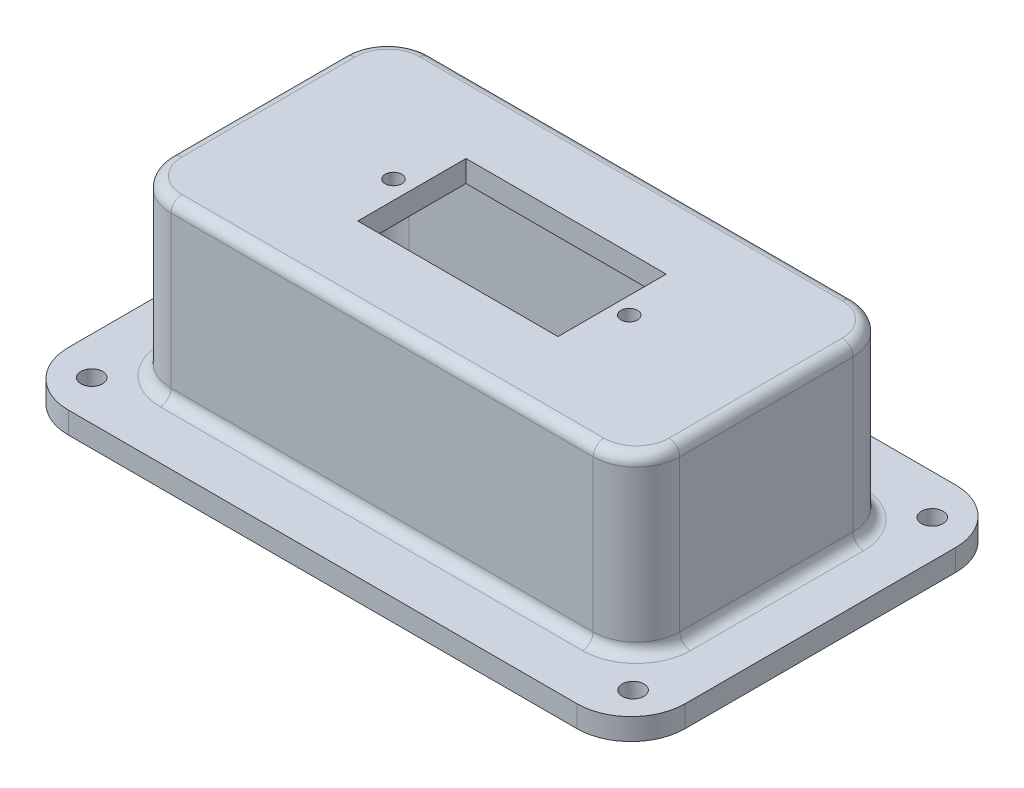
ISO-10303-21;
HEADER;
FILE_DESCRIPTION(('STEP AP214'),'2;1');
FILE_NAME('part.step','',(''),(''),'','','');
FILE_SCHEMA(('AUTOMOTIVE_DESIGN { 1 0 10303 214 1 1 1 1 }'));
ENDSEC;
DATA;
#1=APPLICATION_CONTEXT('core data for automotive mechanical design processes');
#2=APPLICATION_PROTOCOL_DEFINITION('international standard','automotive_design',2000,#1);
#3=PRODUCT_CONTEXT('',#1,'mechanical');
#4=PRODUCT('Part','Part','',(#3));
#5=PRODUCT_RELATED_PRODUCT_CATEGORY('part','',(#4));
#6=PRODUCT_DEFINITION_FORMATION('','',#4);
#7=PRODUCT_DEFINITION_CONTEXT('part definition',#1,'design');
#8=PRODUCT_DEFINITION('design','',#6,#7);
#9=PRODUCT_DEFINITION_SHAPE('','',#8);
#10=(LENGTH_UNIT() NAMED_UNIT(*) SI_UNIT(.MILLI.,.METRE.));
#11=(NAMED_UNIT(*) PLANE_ANGLE_UNIT() SI_UNIT($,.RADIAN.));
#12=(NAMED_UNIT(*) SI_UNIT($,.STERADIAN.) SOLID_ANGLE_UNIT());
#13=UNCERTAINTY_MEASURE_WITH_UNIT(LENGTH_MEASURE(1.E-05),#10,'distance_accuracy_value','');
#14=(GEOMETRIC_REPRESENTATION_CONTEXT(3) GLOBAL_UNCERTAINTY_ASSIGNED_CONTEXT((#13)) GLOBAL_UNIT_ASSIGNED_CONTEXT((#10,
#11,#12)) REPRESENTATION_CONTEXT('',''));
#15=CARTESIAN_POINT('',(0.,0.,0.));
#16=DIRECTION('',(0.,0.,1.));
#17=DIRECTION('',(1.,0.,0.));
#18=AXIS2_PLACEMENT_3D('',#15,#16,#17);
#19=CARTESIAN_POINT('',(29.845,2.54,15.875));
#20=DIRECTION('',(0.,1.,0.));
#21=DIRECTION('',(0.,0.,1.));
#22=AXIS2_PLACEMENT_3D('',#19,#20,#21);
#23=PLANE('',#22);
#24=CARTESIAN_POINT('',(-31.7624636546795,2.54,-17.5548793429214));
#25=DIRECTION('',(0.,1.,0.));
#26=DIRECTION('',(0.,0.,-1.));
#27=AXIS2_PLACEMENT_3D('',#24,#25,#26);
#28=CIRCLE('',#27,1.27);
#29=CARTESIAN_POINT('',(-31.7624636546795,2.54,-18.8248793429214));
#30=VERTEX_POINT('',#29);
#31=EDGE_CURVE('E1053',#30,#30,#28,.T.);
#32=ORIENTED_EDGE('',*,*,#31,.F.);
#33=EDGE_LOOP('',(#32));
#34=FACE_BOUND('',#33,.T.);
#35=CARTESIAN_POINT('',(31.7624636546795,2.54,-17.5548793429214));
#36=DIRECTION('',(0.,1.,0.));
#37=DIRECTION('',(0.,0.,1.));
#38=AXIS2_PLACEMENT_3D('',#35,#36,#37);
#39=CIRCLE('',#38,1.27);
#40=CARTESIAN_POINT('',(31.7624636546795,2.54,-16.2848793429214));
#41=VERTEX_POINT('',#40);
#42=EDGE_CURVE('E1059',#41,#41,#39,.T.);
#43=ORIENTED_EDGE('',*,*,#42,.F.);
#44=EDGE_LOOP('',(#43));
#45=FACE_BOUND('',#44,.T.);
#46=CARTESIAN_POINT('',(31.7624636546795,2.54,17.5548793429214));
#47=DIRECTION('',(0.,1.,0.));
#48=DIRECTION('',(0.,0.,-1.));
#49=AXIS2_PLACEMENT_3D('',#46,#47,#48);
#50=CIRCLE('',#49,1.27);
#51=CARTESIAN_POINT('',(31.7624636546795,2.54,16.2848793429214));
#52=VERTEX_POINT('',#51);
#53=EDGE_CURVE('E1067',#52,#52,#50,.T.);
#54=ORIENTED_EDGE('',*,*,#53,.F.);
#55=EDGE_LOOP('',(#54));
#56=FACE_BOUND('',#55,.T.);
#57=CARTESIAN_POINT('',(-31.7624636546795,2.54,17.5548793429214));
#58=DIRECTION('',(0.,1.,0.));
#59=DIRECTION('',(0.,0.,1.));
#60=AXIS2_PLACEMENT_3D('',#57,#58,#59);
#61=CIRCLE('',#60,1.27);
#62=CARTESIAN_POINT('',(-31.7624636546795,2.54,18.8248793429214));
#63=VERTEX_POINT('',#62);
#64=EDGE_CURVE('E1056',#63,#63,#61,.T.);
#65=ORIENTED_EDGE('',*,*,#64,.F.);
#66=EDGE_LOOP('',(#65));
#67=FACE_BOUND('',#66,.T.);
#68=DIRECTION('',(1.,0.,0.));
#69=VECTOR('',#68,1.);
#70=CARTESIAN_POINT('',(29.845,2.54,16.51));
#71=LINE('',#70,#69);
#72=CARTESIAN_POINT('',(24.765,2.54,16.51));
#73=VERTEX_POINT('',#72);
#74=CARTESIAN_POINT('',(-24.765,2.54,16.51));
#75=VERTEX_POINT('',#74);
#76=EDGE_CURVE('E562',#73,#75,#71,.F.);
#77=ORIENTED_EDGE('',*,*,#76,.T.);
#78=CARTESIAN_POINT('',(-24.765,2.54,10.16));
#79=DIRECTION('',(0.,1.,0.));
#80=DIRECTION('',(0.,0.,1.));
#81=AXIS2_PLACEMENT_3D('',#78,#79,#80);
#82=CIRCLE('',#81,6.35);
#83=CARTESIAN_POINT('',(-31.115,2.54,10.16));
#84=VERTEX_POINT('',#83);
#85=EDGE_CURVE('E576',#75,#84,#82,.F.);
#86=ORIENTED_EDGE('',*,*,#85,.T.);
#87=DIRECTION('',(0.,0.,1.));
#88=VECTOR('',#87,1.);
#89=CARTESIAN_POINT('',(-31.115,2.54,15.875));
#90=LINE('',#89,#88);
#91=CARTESIAN_POINT('',(-31.115,2.54,-10.16));
#92=VERTEX_POINT('',#91);
#93=EDGE_CURVE('E574',#84,#92,#90,.F.);
#94=ORIENTED_EDGE('',*,*,#93,.T.);
#95=CARTESIAN_POINT('',(-24.765,2.54,-10.16));
#96=DIRECTION('',(0.,1.,0.));
#97=DIRECTION('',(0.,0.,1.));
#98=AXIS2_PLACEMENT_3D('',#95,#96,#97);
#99=CIRCLE('',#98,6.35);
#100=CARTESIAN_POINT('',(-24.765,2.54,-16.51));
#101=VERTEX_POINT('',#100);
#102=EDGE_CURVE('E572',#92,#101,#99,.F.);
#103=ORIENTED_EDGE('',*,*,#102,.T.);
#104=DIRECTION('',(-1.,0.,0.));
#105=VECTOR('',#104,1.);
#106=CARTESIAN_POINT('',(29.845,2.54,-16.51));
#107=LINE('',#106,#105);
#108=CARTESIAN_POINT('',(24.765,2.54,-16.51));
#109=VERTEX_POINT('',#108);
#110=EDGE_CURVE('E570',#101,#109,#107,.F.);
#111=ORIENTED_EDGE('',*,*,#110,.T.);
#112=CARTESIAN_POINT('',(24.765,2.54,-10.16));
#113=DIRECTION('',(0.,1.,0.));
#114=DIRECTION('',(0.,0.,1.));
#115=AXIS2_PLACEMENT_3D('',#112,#113,#114);
#116=CIRCLE('',#115,6.35);
#117=CARTESIAN_POINT('',(31.115,2.54,-10.16));
#118=VERTEX_POINT('',#117);
#119=EDGE_CURVE('E568',#109,#118,#116,.F.);
#120=ORIENTED_EDGE('',*,*,#119,.T.);
#121=DIRECTION('',(0.,0.,-1.));
#122=VECTOR('',#121,1.);
#123=CARTESIAN_POINT('',(31.115,2.54,15.875));
#124=LINE('',#123,#122);
#125=CARTESIAN_POINT('',(31.115,2.54,10.16));
#126=VERTEX_POINT('',#125);
#127=EDGE_CURVE('E566',#118,#126,#124,.F.);
#128=ORIENTED_EDGE('',*,*,#127,.T.);
#129=CARTESIAN_POINT('',(24.765,2.54,10.16));
#130=DIRECTION('',(0.,1.,0.));
#131=DIRECTION('',(0.,0.,1.));
#132=AXIS2_PLACEMENT_3D('',#129,#130,#131);
#133=CIRCLE('',#132,6.35);
#134=EDGE_CURVE('E564',#126,#73,#133,.F.);
#135=ORIENTED_EDGE('',*,*,#134,.T.);
#136=EDGE_LOOP('',(#77,#86,#94,#103,#111,#120,#128,#135));
#137=FACE_BOUND('',#136,.T.);
#138=CARTESIAN_POINT('',(29.845,2.54,15.875));
#139=DIRECTION('',(0.,1.,0.));
#140=DIRECTION('',(0.,0.,1.));
#141=AXIS2_PLACEMENT_3D('',#138,#139,#140);
#142=CIRCLE('',#141,6.35);
#143=CARTESIAN_POINT('',(29.845,2.54,22.225));
#144=VERTEX_POINT('',#143);
#145=CARTESIAN_POINT('',(36.195,2.54,15.875));
#146=VERTEX_POINT('',#145);
#147=EDGE_CURVE('E446',#144,#146,#142,.T.);
#148=ORIENTED_EDGE('',*,*,#147,.T.);
#149=DIRECTION('',(0.,0.,-1.));
#150=VECTOR('',#149,1.);
#151=CARTESIAN_POINT('',(36.195,2.54,-15.875));
#152=LINE('',#151,#150);
#153=CARTESIAN_POINT('',(36.195,2.54,-15.875));
#154=VERTEX_POINT('',#153);
#155=EDGE_CURVE('E449',#146,#154,#152,.T.);
#156=ORIENTED_EDGE('',*,*,#155,.T.);
#157=CARTESIAN_POINT('',(29.845,2.54,-15.875));
#158=DIRECTION('',(0.,1.,0.));
#159=DIRECTION('',(0.,0.,1.));
#160=AXIS2_PLACEMENT_3D('',#157,#158,#159);
#161=CIRCLE('',#160,6.35);
#162=CARTESIAN_POINT('',(29.845,2.54,-22.225));
#163=VERTEX_POINT('',#162);
#164=EDGE_CURVE('E452',#154,#163,#161,.T.);
#165=ORIENTED_EDGE('',*,*,#164,.T.);
#166=DIRECTION('',(-1.,0.,0.));
#167=VECTOR('',#166,1.);
#168=CARTESIAN_POINT('',(-29.845,2.54,-22.225));
#169=LINE('',#168,#167);
#170=CARTESIAN_POINT('',(-29.845,2.54,-22.225));
#171=VERTEX_POINT('',#170);
#172=EDGE_CURVE('E454',#163,#171,#169,.T.);
#173=ORIENTED_EDGE('',*,*,#172,.T.);
#174=CARTESIAN_POINT('',(-29.845,2.54,-15.875));
#175=DIRECTION('',(0.,1.,0.));
#176=DIRECTION('',(0.,0.,1.));
#177=AXIS2_PLACEMENT_3D('',#174,#175,#176);
#178=CIRCLE('',#177,6.35);
#179=CARTESIAN_POINT('',(-36.195,2.54,-15.875));
#180=VERTEX_POINT('',#179);
#181=EDGE_CURVE('E456',#171,#180,#178,.T.);
#182=ORIENTED_EDGE('',*,*,#181,.T.);
#183=DIRECTION('',(0.,0.,1.));
#184=VECTOR('',#183,1.);
#185=CARTESIAN_POINT('',(-36.195,2.54,-15.875));
#186=LINE('',#185,#184);
#187=CARTESIAN_POINT('',(-36.195,2.54,15.8749999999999));
#188=VERTEX_POINT('',#187);
#189=EDGE_CURVE('E458',#180,#188,#186,.T.);
#190=ORIENTED_EDGE('',*,*,#189,.T.);
#191=CARTESIAN_POINT('',(-29.845,2.54,15.875));
#192=DIRECTION('',(0.,1.,0.));
#193=DIRECTION('',(0.,0.,1.));
#194=AXIS2_PLACEMENT_3D('',#191,#192,#193);
#195=CIRCLE('',#194,6.35);
#196=CARTESIAN_POINT('',(-29.845,2.54,22.225));
#197=VERTEX_POINT('',#196);
#198=EDGE_CURVE('E460',#188,#197,#195,.T.);
#199=ORIENTED_EDGE('',*,*,#198,.T.);
#200=DIRECTION('',(1.,0.,0.));
#201=VECTOR('',#200,1.);
#202=CARTESIAN_POINT('',(-29.845,2.54,22.225));
#203=LINE('',#202,#201);
#204=EDGE_CURVE('E462',#197,#144,#203,.T.);
#205=ORIENTED_EDGE('',*,*,#204,.T.);
#206=EDGE_LOOP('',(#148,#156,#165,#173,#182,#190,#199,#205));
#207=FACE_BOUND('',#206,.T.);
#208=ADVANCED_FACE('F32',(#34,#45,#56,#67,#137,#207),#23,.T.);
#209=CARTESIAN_POINT('',(29.845,0.,15.875));
#210=DIRECTION('',(0.,1.,0.));
#211=DIRECTION('',(0.,0.,1.));
#212=AXIS2_PLACEMENT_3D('',#209,#210,#211);
#213=PLANE('',#212);
#214=CARTESIAN_POINT('',(-31.7624636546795,0.,-17.5548793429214));
#215=DIRECTION('',(0.,1.,0.));
#216=DIRECTION('',(0.,0.,-1.));
#217=AXIS2_PLACEMENT_3D('',#214,#215,#216);
#218=CIRCLE('',#217,1.27);
#219=CARTESIAN_POINT('',(-31.7624636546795,0.,-18.8248793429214));
#220=VERTEX_POINT('',#219);
#221=EDGE_CURVE('E1051',#220,#220,#218,.T.);
#222=ORIENTED_EDGE('',*,*,#221,.T.);
#223=EDGE_LOOP('',(#222));
#224=FACE_BOUND('',#223,.T.);
#225=CARTESIAN_POINT('',(31.7624636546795,0.,-17.5548793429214));
#226=DIRECTION('',(0.,1.,0.));
#227=DIRECTION('',(0.,0.,1.));
#228=AXIS2_PLACEMENT_3D('',#225,#226,#227);
#229=CIRCLE('',#228,1.27);
#230=CARTESIAN_POINT('',(31.7624636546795,0.,-16.2848793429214));
#231=VERTEX_POINT('',#230);
#232=EDGE_CURVE('E1054',#231,#231,#229,.T.);
#233=ORIENTED_EDGE('',*,*,#232,.T.);
#234=EDGE_LOOP('',(#233));
#235=FACE_BOUND('',#234,.T.);
#236=CARTESIAN_POINT('',(31.7624636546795,0.,17.5548793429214));
#237=DIRECTION('',(0.,1.,0.));
#238=DIRECTION('',(0.,0.,-1.));
#239=AXIS2_PLACEMENT_3D('',#236,#237,#238);
#240=CIRCLE('',#239,1.27);
#241=CARTESIAN_POINT('',(31.7624636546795,0.,16.2848793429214));
#242=VERTEX_POINT('',#241);
#243=EDGE_CURVE('E1064',#242,#242,#240,.T.);
#244=ORIENTED_EDGE('',*,*,#243,.T.);
#245=EDGE_LOOP('',(#244));
#246=FACE_BOUND('',#245,.T.);
#247=CARTESIAN_POINT('',(-31.7624636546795,0.,17.5548793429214));
#248=DIRECTION('',(0.,1.,0.));
#249=DIRECTION('',(0.,0.,1.));
#250=AXIS2_PLACEMENT_3D('',#247,#248,#249);
#251=CIRCLE('',#250,1.27);
#252=CARTESIAN_POINT('',(-31.7624636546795,0.,18.8248793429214));
#253=VERTEX_POINT('',#252);
#254=EDGE_CURVE('E320',#253,#253,#251,.T.);
#255=ORIENTED_EDGE('',*,*,#254,.T.);
#256=EDGE_LOOP('',(#255));
#257=FACE_BOUND('',#256,.T.);
#258=CARTESIAN_POINT('',(29.845,0.,15.875));
#259=DIRECTION('',(0.,1.,0.));
#260=DIRECTION('',(0.,0.,1.));
#261=AXIS2_PLACEMENT_3D('',#258,#259,#260);
#262=CIRCLE('',#261,6.35);
#263=CARTESIAN_POINT('',(29.845,0.,22.225));
#264=VERTEX_POINT('',#263);
#265=CARTESIAN_POINT('',(36.195,0.,15.875));
#266=VERTEX_POINT('',#265);
#267=EDGE_CURVE('E445',#264,#266,#262,.T.);
#268=ORIENTED_EDGE('',*,*,#267,.F.);
#269=DIRECTION('',(1.,0.,0.));
#270=VECTOR('',#269,1.);
#271=CARTESIAN_POINT('',(-29.845,0.,22.225));
#272=LINE('',#271,#270);
#273=CARTESIAN_POINT('',(-29.845,0.,22.225));
#274=VERTEX_POINT('',#273);
#275=EDGE_CURVE('E450',#274,#264,#272,.T.);
#276=ORIENTED_EDGE('',*,*,#275,.F.);
#277=CARTESIAN_POINT('',(-29.845,0.,15.875));
#278=DIRECTION('',(0.,1.,0.));
#279=DIRECTION('',(0.,0.,1.));
#280=AXIS2_PLACEMENT_3D('',#277,#278,#279);
#281=CIRCLE('',#280,6.35);
#282=CARTESIAN_POINT('',(-36.195,0.,15.8749999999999));
#283=VERTEX_POINT('',#282);
#284=EDGE_CURVE('E477',#283,#274,#281,.T.);
#285=ORIENTED_EDGE('',*,*,#284,.F.);
#286=DIRECTION('',(0.,0.,1.));
#287=VECTOR('',#286,1.);
#288=CARTESIAN_POINT('',(-36.195,0.,-15.875));
#289=LINE('',#288,#287);
#290=CARTESIAN_POINT('',(-36.195,0.,-15.875));
#291=VERTEX_POINT('',#290);
#292=EDGE_CURVE('E475',#291,#283,#289,.T.);
#293=ORIENTED_EDGE('',*,*,#292,.F.);
#294=CARTESIAN_POINT('',(-29.845,0.,-15.875));
#295=DIRECTION('',(0.,1.,0.));
#296=DIRECTION('',(0.,0.,1.));
#297=AXIS2_PLACEMENT_3D('',#294,#295,#296);
#298=CIRCLE('',#297,6.35);
#299=CARTESIAN_POINT('',(-29.845,0.,-22.225));
#300=VERTEX_POINT('',#299);
#301=EDGE_CURVE('E473',#300,#291,#298,.T.);
#302=ORIENTED_EDGE('',*,*,#301,.F.);
#303=DIRECTION('',(-1.,0.,0.));
#304=VECTOR('',#303,1.);
#305=CARTESIAN_POINT('',(-29.845,0.,-22.225));
#306=LINE('',#305,#304);
#307=CARTESIAN_POINT('',(29.845,0.,-22.225));
#308=VERTEX_POINT('',#307);
#309=EDGE_CURVE('E471',#308,#300,#306,.T.);
#310=ORIENTED_EDGE('',*,*,#309,.F.);
#311=CARTESIAN_POINT('',(29.845,0.,-15.875));
#312=DIRECTION('',(0.,1.,0.));
#313=DIRECTION('',(0.,0.,1.));
#314=AXIS2_PLACEMENT_3D('',#311,#312,#313);
#315=CIRCLE('',#314,6.35);
#316=CARTESIAN_POINT('',(36.195,0.,-15.875));
#317=VERTEX_POINT('',#316);
#318=EDGE_CURVE('E469',#317,#308,#315,.T.);
#319=ORIENTED_EDGE('',*,*,#318,.F.);
#320=DIRECTION('',(0.,0.,-1.));
#321=VECTOR('',#320,1.);
#322=CARTESIAN_POINT('',(36.195,0.,-15.875));
#323=LINE('',#322,#321);
#324=EDGE_CURVE('E467',#266,#317,#323,.T.);
#325=ORIENTED_EDGE('',*,*,#324,.F.);
#326=EDGE_LOOP('',(#268,#276,#285,#293,#302,#310,#319,#325));
#327=FACE_BOUND('',#326,.T.);
#328=CARTESIAN_POINT('',(-24.765,0.,10.16));
#329=DIRECTION('',(0.,1.,0.));
#330=DIRECTION('',(0.,0.,1.));
#331=AXIS2_PLACEMENT_3D('',#328,#329,#330);
#332=CIRCLE('',#331,2.54);
#333=CARTESIAN_POINT('',(-27.305,0.,10.16));
#334=VERTEX_POINT('',#333);
#335=CARTESIAN_POINT('',(-24.765,0.,12.7));
#336=VERTEX_POINT('',#335);
#337=EDGE_CURVE('E403',#334,#336,#332,.T.);
#338=ORIENTED_EDGE('',*,*,#337,.T.);
#339=DIRECTION('',(1.,0.,0.));
#340=VECTOR('',#339,1.);
#341=CARTESIAN_POINT('',(-24.765,0.,12.7));
#342=LINE('',#341,#340);
#343=CARTESIAN_POINT('',(24.765,0.,12.7));
#344=VERTEX_POINT('',#343);
#345=EDGE_CURVE('E406',#336,#344,#342,.T.);
#346=ORIENTED_EDGE('',*,*,#345,.T.);
#347=CARTESIAN_POINT('',(24.765,0.,10.16));
#348=DIRECTION('',(0.,1.,0.));
#349=DIRECTION('',(0.,0.,-1.));
#350=AXIS2_PLACEMENT_3D('',#347,#348,#349);
#351=CIRCLE('',#350,2.54);
#352=CARTESIAN_POINT('',(27.305,0.,10.16));
#353=VERTEX_POINT('',#352);
#354=EDGE_CURVE('E409',#344,#353,#351,.T.);
#355=ORIENTED_EDGE('',*,*,#354,.T.);
#356=DIRECTION('',(0.,0.,-1.));
#357=VECTOR('',#356,1.);
#358=CARTESIAN_POINT('',(27.305,0.,-10.16));
#359=LINE('',#358,#357);
#360=CARTESIAN_POINT('',(27.305,0.,-10.16));
#361=VERTEX_POINT('',#360);
#362=EDGE_CURVE('E412',#353,#361,#359,.T.);
#363=ORIENTED_EDGE('',*,*,#362,.T.);
#364=CARTESIAN_POINT('',(24.765,0.,-10.16));
#365=DIRECTION('',(0.,1.,0.));
#366=DIRECTION('',(0.,0.,1.));
#367=AXIS2_PLACEMENT_3D('',#364,#365,#366);
#368=CIRCLE('',#367,2.54);
#369=CARTESIAN_POINT('',(24.765,0.,-12.7));
#370=VERTEX_POINT('',#369);
#371=EDGE_CURVE('E415',#361,#370,#368,.T.);
#372=ORIENTED_EDGE('',*,*,#371,.T.);
#373=DIRECTION('',(-1.,0.,0.));
#374=VECTOR('',#373,1.);
#375=CARTESIAN_POINT('',(-24.765,0.,-12.7));
#376=LINE('',#375,#374);
#377=CARTESIAN_POINT('',(-24.765,0.,-12.7));
#378=VERTEX_POINT('',#377);
#379=EDGE_CURVE('E418',#370,#378,#376,.T.);
#380=ORIENTED_EDGE('',*,*,#379,.T.);
#381=CARTESIAN_POINT('',(-24.765,0.,-10.16));
#382=DIRECTION('',(0.,1.,0.));
#383=DIRECTION('',(0.,0.,1.));
#384=AXIS2_PLACEMENT_3D('',#381,#382,#383);
#385=CIRCLE('',#384,2.54);
#386=CARTESIAN_POINT('',(-27.305,0.,-10.16));
#387=VERTEX_POINT('',#386);
#388=EDGE_CURVE('E421',#378,#387,#385,.T.);
#389=ORIENTED_EDGE('',*,*,#388,.T.);
#390=DIRECTION('',(0.,0.,1.));
#391=VECTOR('',#390,1.);
#392=CARTESIAN_POINT('',(-27.305,0.,-10.16));
#393=LINE('',#392,#391);
#394=EDGE_CURVE('E424',#387,#334,#393,.T.);
#395=ORIENTED_EDGE('',*,*,#394,.T.);
#396=EDGE_LOOP('',(#338,#346,#355,#363,#372,#380,#389,#395));
#397=FACE_BOUND('',#396,.T.);
#398=ADVANCED_FACE('F645',(#224,#235,#246,#257,#327,#397),#213,.F.);
#399=CARTESIAN_POINT('',(29.845,2.54,15.875));
#400=DIRECTION('',(0.,-1.,0.));
#401=DIRECTION('',(0.,0.,-1.));
#402=AXIS2_PLACEMENT_3D('',#399,#400,#401);
#403=CYLINDRICAL_SURFACE('',#402,6.35);
#404=ORIENTED_EDGE('',*,*,#267,.T.);
#405=DIRECTION('',(0.,-1.,0.));
#406=VECTOR('',#405,1.);
#407=CARTESIAN_POINT('',(36.195,2.54,15.875));
#408=LINE('',#407,#406);
#409=EDGE_CURVE('E500',#146,#266,#408,.T.);
#410=ORIENTED_EDGE('',*,*,#409,.F.);
#411=ORIENTED_EDGE('',*,*,#147,.F.);
#412=DIRECTION('',(0.,-1.,0.));
#413=VECTOR('',#412,1.);
#414=CARTESIAN_POINT('',(29.845,2.54,22.225));
#415=LINE('',#414,#413);
#416=EDGE_CURVE('E464',#144,#264,#415,.T.);
#417=ORIENTED_EDGE('',*,*,#416,.T.);
#418=EDGE_LOOP('',(#404,#410,#411,#417));
#419=FACE_BOUND('',#418,.T.);
#420=ADVANCED_FACE('F651',(#419),#403,.T.);
#421=CARTESIAN_POINT('',(36.195,2.54,-15.875));
#422=DIRECTION('',(-1.,0.,0.));
#423=DIRECTION('',(0.,0.,1.));
#424=AXIS2_PLACEMENT_3D('',#421,#422,#423);
#425=PLANE('',#424);
#426=ORIENTED_EDGE('',*,*,#324,.T.);
#427=DIRECTION('',(0.,-1.,0.));
#428=VECTOR('',#427,1.);
#429=CARTESIAN_POINT('',(36.195,2.54,-15.875));
#430=LINE('',#429,#428);
#431=EDGE_CURVE('E497',#154,#317,#430,.T.);
#432=ORIENTED_EDGE('',*,*,#431,.F.);
#433=ORIENTED_EDGE('',*,*,#155,.F.);
#434=ORIENTED_EDGE('',*,*,#409,.T.);
#435=EDGE_LOOP('',(#426,#432,#433,#434));
#436=FACE_BOUND('',#435,.T.);
#437=ADVANCED_FACE('F683',(#436),#425,.F.);
#438=CARTESIAN_POINT('',(29.845,2.54,-15.875));
#439=DIRECTION('',(0.,-1.,0.));
#440=DIRECTION('',(0.,0.,-1.));
#441=AXIS2_PLACEMENT_3D('',#438,#439,#440);
#442=CYLINDRICAL_SURFACE('',#441,6.35);
#443=ORIENTED_EDGE('',*,*,#318,.T.);
#444=DIRECTION('',(0.,-1.,0.));
#445=VECTOR('',#444,1.);
#446=CARTESIAN_POINT('',(29.845,2.54,-22.225));
#447=LINE('',#446,#445);
#448=EDGE_CURVE('E494',#163,#308,#447,.T.);
#449=ORIENTED_EDGE('',*,*,#448,.F.);
#450=ORIENTED_EDGE('',*,*,#164,.F.);
#451=ORIENTED_EDGE('',*,*,#431,.T.);
#452=EDGE_LOOP('',(#443,#449,#450,#451));
#453=FACE_BOUND('',#452,.T.);
#454=ADVANCED_FACE('F679',(#453),#442,.T.);
#455=CARTESIAN_POINT('',(-29.845,2.54,-22.225));
#456=DIRECTION('',(0.,0.,1.));
#457=DIRECTION('',(1.,0.,0.));
#458=AXIS2_PLACEMENT_3D('',#455,#456,#457);
#459=PLANE('',#458);
#460=ORIENTED_EDGE('',*,*,#309,.T.);
#461=DIRECTION('',(0.,-1.,0.));
#462=VECTOR('',#461,1.);
#463=CARTESIAN_POINT('',(-29.845,2.54,-22.225));
#464=LINE('',#463,#462);
#465=EDGE_CURVE('E491',#171,#300,#464,.T.);
#466=ORIENTED_EDGE('',*,*,#465,.F.);
#467=ORIENTED_EDGE('',*,*,#172,.F.);
#468=ORIENTED_EDGE('',*,*,#448,.T.);
#469=EDGE_LOOP('',(#460,#466,#467,#468));
#470=FACE_BOUND('',#469,.T.);
#471=ADVANCED_FACE('F675',(#470),#459,.F.);
#472=CARTESIAN_POINT('',(-29.845,2.54,-15.875));
#473=DIRECTION('',(0.,-1.,0.));
#474=DIRECTION('',(0.,0.,-1.));
#475=AXIS2_PLACEMENT_3D('',#472,#473,#474);
#476=CYLINDRICAL_SURFACE('',#475,6.35);
#477=ORIENTED_EDGE('',*,*,#301,.T.);
#478=DIRECTION('',(0.,-1.,0.));
#479=VECTOR('',#478,1.);
#480=CARTESIAN_POINT('',(-36.195,2.54,-15.875));
#481=LINE('',#480,#479);
#482=EDGE_CURVE('E488',#180,#291,#481,.T.);
#483=ORIENTED_EDGE('',*,*,#482,.F.);
#484=ORIENTED_EDGE('',*,*,#181,.F.);
#485=ORIENTED_EDGE('',*,*,#465,.T.);
#486=EDGE_LOOP('',(#477,#483,#484,#485));
#487=FACE_BOUND('',#486,.T.);
#488=ADVANCED_FACE('F671',(#487),#476,.T.);
#489=CARTESIAN_POINT('',(-36.195,2.54,-15.875));
#490=DIRECTION('',(1.,0.,0.));
#491=DIRECTION('',(0.,0.,-1.));
#492=AXIS2_PLACEMENT_3D('',#489,#490,#491);
#493=PLANE('',#492);
#494=ORIENTED_EDGE('',*,*,#292,.T.);
#495=DIRECTION('',(0.,-1.,0.));
#496=VECTOR('',#495,1.);
#497=CARTESIAN_POINT('',(-36.195,2.54,15.8749999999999));
#498=LINE('',#497,#496);
#499=EDGE_CURVE('E485',#188,#283,#498,.T.);
#500=ORIENTED_EDGE('',*,*,#499,.F.);
#501=ORIENTED_EDGE('',*,*,#189,.F.);
#502=ORIENTED_EDGE('',*,*,#482,.T.);
#503=EDGE_LOOP('',(#494,#500,#501,#502));
#504=FACE_BOUND('',#503,.T.);
#505=ADVANCED_FACE('F667',(#504),#493,.F.);
#506=CARTESIAN_POINT('',(-29.845,2.54,15.875));
#507=DIRECTION('',(0.,-1.,0.));
#508=DIRECTION('',(0.,0.,-1.));
#509=AXIS2_PLACEMENT_3D('',#506,#507,#508);
#510=CYLINDRICAL_SURFACE('',#509,6.35);
#511=ORIENTED_EDGE('',*,*,#284,.T.);
#512=DIRECTION('',(0.,-1.,0.));
#513=VECTOR('',#512,1.);
#514=CARTESIAN_POINT('',(-29.845,2.54,22.225));
#515=LINE('',#514,#513);
#516=EDGE_CURVE('E482',#197,#274,#515,.T.);
#517=ORIENTED_EDGE('',*,*,#516,.F.);
#518=ORIENTED_EDGE('',*,*,#198,.F.);
#519=ORIENTED_EDGE('',*,*,#499,.T.);
#520=EDGE_LOOP('',(#511,#517,#518,#519));
#521=FACE_BOUND('',#520,.T.);
#522=ADVANCED_FACE('F663',(#521),#510,.T.);
#523=CARTESIAN_POINT('',(-29.845,2.54,22.225));
#524=DIRECTION('',(0.,0.,-1.));
#525=DIRECTION('',(-1.,0.,0.));
#526=AXIS2_PLACEMENT_3D('',#523,#524,#525);
#527=PLANE('',#526);
#528=ORIENTED_EDGE('',*,*,#275,.T.);
#529=ORIENTED_EDGE('',*,*,#416,.F.);
#530=ORIENTED_EDGE('',*,*,#204,.F.);
#531=ORIENTED_EDGE('',*,*,#516,.T.);
#532=EDGE_LOOP('',(#528,#529,#530,#531));
#533=FACE_BOUND('',#532,.T.);
#534=ADVANCED_FACE('F660',(#533),#527,.F.);
#535=CARTESIAN_POINT('',(-24.765,2.54,10.16));
#536=DIRECTION('',(0.,-1.,0.));
#537=DIRECTION('',(0.,0.,-1.));
#538=AXIS2_PLACEMENT_3D('',#535,#536,#537);
#539=CYLINDRICAL_SURFACE('',#538,2.54);
#540=ORIENTED_EDGE('',*,*,#337,.F.);
#541=DIRECTION('',(0.,-1.,0.));
#542=VECTOR('',#541,1.);
#543=CARTESIAN_POINT('',(-27.305,2.54,10.16));
#544=LINE('',#543,#542);
#545=CARTESIAN_POINT('',(-27.305,20.32,10.16));
#546=VERTEX_POINT('',#545);
#547=EDGE_CURVE('E427',#546,#334,#544,.T.);
#548=ORIENTED_EDGE('',*,*,#547,.F.);
#549=CARTESIAN_POINT('',(-24.765,20.32,10.16));
#550=DIRECTION('',(0.,1.,0.));
#551=DIRECTION('',(0.,0.,1.));
#552=AXIS2_PLACEMENT_3D('',#549,#550,#551);
#553=CIRCLE('',#552,2.54);
#554=CARTESIAN_POINT('',(-24.765,20.32,12.7));
#555=VERTEX_POINT('',#554);
#556=EDGE_CURVE('E349',#546,#555,#553,.T.);
#557=ORIENTED_EDGE('',*,*,#556,.T.);
#558=DIRECTION('',(0.,-1.,0.));
#559=VECTOR('',#558,1.);
#560=CARTESIAN_POINT('',(-24.765,2.54,12.7));
#561=LINE('',#560,#559);
#562=EDGE_CURVE('E442',#555,#336,#561,.T.);
#563=ORIENTED_EDGE('',*,*,#562,.T.);
#564=EDGE_LOOP('',(#540,#548,#557,#563));
#565=FACE_BOUND('',#564,.T.);
#566=ADVANCED_FACE('F657',(#565),#539,.F.);
#567=CARTESIAN_POINT('',(-24.765,2.54,12.7));
#568=DIRECTION('',(0.,0.,-1.));
#569=DIRECTION('',(-1.,0.,0.));
#570=AXIS2_PLACEMENT_3D('',#567,#568,#569);
#571=PLANE('',#570);
#572=ORIENTED_EDGE('',*,*,#345,.F.);
#573=ORIENTED_EDGE('',*,*,#562,.F.);
#574=DIRECTION('',(1.,0.,0.));
#575=VECTOR('',#574,1.);
#576=CARTESIAN_POINT('',(-24.765,20.32,12.7));
#577=LINE('',#576,#575);
#578=CARTESIAN_POINT('',(24.765,20.32,12.7));
#579=VERTEX_POINT('',#578);
#580=EDGE_CURVE('E358',#555,#579,#577,.T.);
#581=ORIENTED_EDGE('',*,*,#580,.T.);
#582=DIRECTION('',(0.,-1.,0.));
#583=VECTOR('',#582,1.);
#584=CARTESIAN_POINT('',(24.765,2.54,12.7));
#585=LINE('',#584,#583);
#586=EDGE_CURVE('E440',#579,#344,#585,.T.);
#587=ORIENTED_EDGE('',*,*,#586,.T.);
#588=EDGE_LOOP('',(#572,#573,#581,#587));
#589=FACE_BOUND('',#588,.T.);
#590=ADVANCED_FACE('F861',(#589),#571,.T.);
#591=CARTESIAN_POINT('',(24.765,2.54,10.16));
#592=DIRECTION('',(0.,-1.,0.));
#593=DIRECTION('',(0.,0.,-1.));
#594=AXIS2_PLACEMENT_3D('',#591,#592,#593);
#595=CYLINDRICAL_SURFACE('',#594,2.54);
#596=ORIENTED_EDGE('',*,*,#354,.F.);
#597=ORIENTED_EDGE('',*,*,#586,.F.);
#598=CARTESIAN_POINT('',(24.765,20.32,10.16));
#599=DIRECTION('',(0.,1.,0.));
#600=DIRECTION('',(0.,0.,1.));
#601=AXIS2_PLACEMENT_3D('',#598,#599,#600);
#602=CIRCLE('',#601,2.54);
#603=CARTESIAN_POINT('',(27.305,20.32,10.16));
#604=VERTEX_POINT('',#603);
#605=EDGE_CURVE('E361',#579,#604,#602,.T.);
#606=ORIENTED_EDGE('',*,*,#605,.T.);
#607=DIRECTION('',(0.,-1.,0.));
#608=VECTOR('',#607,1.);
#609=CARTESIAN_POINT('',(27.305,2.54,10.16));
#610=LINE('',#609,#608);
#611=EDGE_CURVE('E438',#604,#353,#610,.T.);
#612=ORIENTED_EDGE('',*,*,#611,.T.);
#613=EDGE_LOOP('',(#596,#597,#606,#612));
#614=FACE_BOUND('',#613,.T.);
#615=ADVANCED_FACE('F858',(#614),#595,.F.);
#616=CARTESIAN_POINT('',(27.305,2.54,-10.16));
#617=DIRECTION('',(-1.,0.,0.));
#618=DIRECTION('',(0.,0.,1.));
#619=AXIS2_PLACEMENT_3D('',#616,#617,#618);
#620=PLANE('',#619);
#621=ORIENTED_EDGE('',*,*,#362,.F.);
#622=ORIENTED_EDGE('',*,*,#611,.F.);
#623=DIRECTION('',(0.,0.,-1.));
#624=VECTOR('',#623,1.);
#625=CARTESIAN_POINT('',(27.305,20.32,10.16));
#626=LINE('',#625,#624);
#627=CARTESIAN_POINT('',(27.305,20.32,-10.16));
#628=VERTEX_POINT('',#627);
#629=EDGE_CURVE('E364',#604,#628,#626,.T.);
#630=ORIENTED_EDGE('',*,*,#629,.T.);
#631=DIRECTION('',(0.,-1.,0.));
#632=VECTOR('',#631,1.);
#633=CARTESIAN_POINT('',(27.305,2.54,-10.16));
#634=LINE('',#633,#632);
#635=EDGE_CURVE('E436',#628,#361,#634,.T.);
#636=ORIENTED_EDGE('',*,*,#635,.T.);
#637=EDGE_LOOP('',(#621,#622,#630,#636));
#638=FACE_BOUND('',#637,.T.);
#639=ADVANCED_FACE('F854',(#638),#620,.T.);
#640=CARTESIAN_POINT('',(24.765,2.54,-10.16));
#641=DIRECTION('',(0.,-1.,0.));
#642=DIRECTION('',(0.,0.,-1.));
#643=AXIS2_PLACEMENT_3D('',#640,#641,#642);
#644=CYLINDRICAL_SURFACE('',#643,2.54);
#645=ORIENTED_EDGE('',*,*,#371,.F.);
#646=ORIENTED_EDGE('',*,*,#635,.F.);
#647=CARTESIAN_POINT('',(24.765,20.32,-10.16));
#648=DIRECTION('',(0.,1.,0.));
#649=DIRECTION('',(0.,0.,1.));
#650=AXIS2_PLACEMENT_3D('',#647,#648,#649);
#651=CIRCLE('',#650,2.54);
#652=CARTESIAN_POINT('',(24.765,20.32,-12.7));
#653=VERTEX_POINT('',#652);
#654=EDGE_CURVE('E367',#628,#653,#651,.T.);
#655=ORIENTED_EDGE('',*,*,#654,.T.);
#656=DIRECTION('',(0.,-1.,0.));
#657=VECTOR('',#656,1.);
#658=CARTESIAN_POINT('',(24.765,2.54,-12.7));
#659=LINE('',#658,#657);
#660=EDGE_CURVE('E434',#653,#370,#659,.T.);
#661=ORIENTED_EDGE('',*,*,#660,.T.);
#662=EDGE_LOOP('',(#645,#646,#655,#661));
#663=FACE_BOUND('',#662,.T.);
#664=ADVANCED_FACE('F850',(#663),#644,.F.);
#665=CARTESIAN_POINT('',(-24.765,2.54,-12.7));
#666=DIRECTION('',(0.,0.,1.));
#667=DIRECTION('',(1.,0.,0.));
#668=AXIS2_PLACEMENT_3D('',#665,#666,#667);
#669=PLANE('',#668);
#670=ORIENTED_EDGE('',*,*,#379,.F.);
#671=ORIENTED_EDGE('',*,*,#660,.F.);
#672=DIRECTION('',(-1.,0.,0.));
#673=VECTOR('',#672,1.);
#674=CARTESIAN_POINT('',(24.765,20.32,-12.7));
#675=LINE('',#674,#673);
#676=CARTESIAN_POINT('',(-24.765,20.32,-12.7));
#677=VERTEX_POINT('',#676);
#678=EDGE_CURVE('E370',#653,#677,#675,.T.);
#679=ORIENTED_EDGE('',*,*,#678,.T.);
#680=DIRECTION('',(0.,-1.,0.));
#681=VECTOR('',#680,1.);
#682=CARTESIAN_POINT('',(-24.765,2.54,-12.7));
#683=LINE('',#682,#681);
#684=EDGE_CURVE('E432',#677,#378,#683,.T.);
#685=ORIENTED_EDGE('',*,*,#684,.T.);
#686=EDGE_LOOP('',(#670,#671,#679,#685));
#687=FACE_BOUND('',#686,.T.);
#688=ADVANCED_FACE('F846',(#687),#669,.T.);
#689=CARTESIAN_POINT('',(-24.765,2.54,-10.16));
#690=DIRECTION('',(0.,-1.,0.));
#691=DIRECTION('',(0.,0.,-1.));
#692=AXIS2_PLACEMENT_3D('',#689,#690,#691);
#693=CYLINDRICAL_SURFACE('',#692,2.54);
#694=ORIENTED_EDGE('',*,*,#388,.F.);
#695=ORIENTED_EDGE('',*,*,#684,.F.);
#696=CARTESIAN_POINT('',(-24.765,20.32,-10.16));
#697=DIRECTION('',(0.,1.,0.));
#698=DIRECTION('',(0.,0.,1.));
#699=AXIS2_PLACEMENT_3D('',#696,#697,#698);
#700=CIRCLE('',#699,2.54);
#701=CARTESIAN_POINT('',(-27.305,20.32,-10.16));
#702=VERTEX_POINT('',#701);
#703=EDGE_CURVE('E373',#677,#702,#700,.T.);
#704=ORIENTED_EDGE('',*,*,#703,.T.);
#705=DIRECTION('',(0.,-1.,0.));
#706=VECTOR('',#705,1.);
#707=CARTESIAN_POINT('',(-27.305,2.54,-10.16));
#708=LINE('',#707,#706);
#709=EDGE_CURVE('E430',#702,#387,#708,.T.);
#710=ORIENTED_EDGE('',*,*,#709,.T.);
#711=EDGE_LOOP('',(#694,#695,#704,#710));
#712=FACE_BOUND('',#711,.T.);
#713=ADVANCED_FACE('F843',(#712),#693,.F.);
#714=CARTESIAN_POINT('',(-27.305,2.54,-10.16));
#715=DIRECTION('',(1.,0.,0.));
#716=DIRECTION('',(0.,0.,-1.));
#717=AXIS2_PLACEMENT_3D('',#714,#715,#716);
#718=PLANE('',#717);
#719=DIRECTION('',(0.,-1.,0.));
#720=VECTOR('',#719,1.);
#721=CARTESIAN_POINT('',(-27.305,0.,-6.35000000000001));
#722=LINE('',#721,#720);
#723=CARTESIAN_POINT('',(-27.305,7.62,-6.35000000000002));
#724=VERTEX_POINT('',#723);
#725=CARTESIAN_POINT('',(-27.305,5.08,-6.35000000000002));
#726=VERTEX_POINT('',#725);
#727=EDGE_CURVE('E306',#724,#726,#722,.T.);
#728=ORIENTED_EDGE('',*,*,#727,.T.);
#729=DIRECTION('',(0.,0.,-1.));
#730=VECTOR('',#729,1.);
#731=CARTESIAN_POINT('',(-27.305,5.08,0.));
#732=LINE('',#731,#730);
#733=CARTESIAN_POINT('',(-27.305,5.08,6.35));
#734=VERTEX_POINT('',#733);
#735=EDGE_CURVE('E291',#734,#726,#732,.T.);
#736=ORIENTED_EDGE('',*,*,#735,.F.);
#737=DIRECTION('',(0.,-1.,0.));
#738=VECTOR('',#737,1.);
#739=CARTESIAN_POINT('',(-27.305,0.,6.35));
#740=LINE('',#739,#738);
#741=CARTESIAN_POINT('',(-27.305,7.62000000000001,6.35));
#742=VERTEX_POINT('',#741);
#743=EDGE_CURVE('E302',#742,#734,#740,.T.);
#744=ORIENTED_EDGE('',*,*,#743,.F.);
#745=DIRECTION('',(0.,0.,-1.));
#746=VECTOR('',#745,1.);
#747=CARTESIAN_POINT('',(-27.305,7.62,0.));
#748=LINE('',#747,#746);
#749=EDGE_CURVE('E314',#742,#724,#748,.T.);
#750=ORIENTED_EDGE('',*,*,#749,.T.);
#751=EDGE_LOOP('',(#728,#736,#744,#750));
#752=FACE_BOUND('',#751,.T.);
#753=ORIENTED_EDGE('',*,*,#394,.F.);
#754=ORIENTED_EDGE('',*,*,#709,.F.);
#755=DIRECTION('',(0.,0.,1.));
#756=VECTOR('',#755,1.);
#757=CARTESIAN_POINT('',(-27.305,20.32,-10.16));
#758=LINE('',#757,#756);
#759=EDGE_CURVE('E376',#702,#546,#758,.T.);
#760=ORIENTED_EDGE('',*,*,#759,.T.);
#761=ORIENTED_EDGE('',*,*,#547,.T.);
#762=EDGE_LOOP('',(#753,#754,#760,#761));
#763=FACE_BOUND('',#762,.T.);
#764=ADVANCED_FACE('F312',(#752,#763),#718,.T.);
#765=CARTESIAN_POINT('',(-24.765,20.32,-10.16));
#766=DIRECTION('',(0.,-1.,0.));
#767=DIRECTION('',(0.,0.,-1.));
#768=AXIS2_PLACEMENT_3D('',#765,#766,#767);
#769=CYLINDRICAL_SURFACE('',#768,5.08);
#770=DIRECTION('',(0.,-1.,0.));
#771=VECTOR('',#770,1.);
#772=CARTESIAN_POINT('',(-29.845,20.32,-10.16));
#773=LINE('',#772,#771);
#774=CARTESIAN_POINT('',(-29.845,21.59,-10.16));
#775=VERTEX_POINT('',#774);
#776=CARTESIAN_POINT('',(-29.845,3.81,-10.16));
#777=VERTEX_POINT('',#776);
#778=EDGE_CURVE('E400',#775,#777,#773,.T.);
#779=ORIENTED_EDGE('',*,*,#778,.F.);
#780=CARTESIAN_POINT('',(-24.765,21.59,-10.16));
#781=DIRECTION('',(0.,1.,0.));
#782=DIRECTION('',(0.,0.,1.));
#783=AXIS2_PLACEMENT_3D('',#780,#781,#782);
#784=CIRCLE('',#783,5.08);
#785=CARTESIAN_POINT('',(-24.765,21.59,-15.24));
#786=VERTEX_POINT('',#785);
#787=EDGE_CURVE('E552',#775,#786,#784,.F.);
#788=ORIENTED_EDGE('',*,*,#787,.T.);
#789=DIRECTION('',(0.,-1.,0.));
#790=VECTOR('',#789,1.);
#791=CARTESIAN_POINT('',(-24.765,20.32,-15.24));
#792=LINE('',#791,#790);
#793=CARTESIAN_POINT('',(-24.765,3.81,-15.24));
#794=VERTEX_POINT('',#793);
#795=EDGE_CURVE('E379',#786,#794,#792,.T.);
#796=ORIENTED_EDGE('',*,*,#795,.T.);
#797=CARTESIAN_POINT('',(-24.765,3.81,-10.16));
#798=DIRECTION('',(0.,1.,0.));
#799=DIRECTION('',(0.,0.,1.));
#800=AXIS2_PLACEMENT_3D('',#797,#798,#799);
#801=CIRCLE('',#800,5.08);
#802=EDGE_CURVE('E550',#794,#777,#801,.T.);
#803=ORIENTED_EDGE('',*,*,#802,.T.);
#804=EDGE_LOOP('',(#779,#788,#796,#803));
#805=FACE_BOUND('',#804,.T.);
#806=ADVANCED_FACE('F791',(#805),#769,.T.);
#807=CARTESIAN_POINT('',(-29.845,20.32,-10.16));
#808=DIRECTION('',(1.,0.,0.));
#809=DIRECTION('',(0.,0.,-1.));
#810=AXIS2_PLACEMENT_3D('',#807,#808,#809);
#811=PLANE('',#810);
#812=DIRECTION('',(0.,0.,-1.));
#813=VECTOR('',#812,1.);
#814=CARTESIAN_POINT('',(-29.845,5.08,0.));
#815=LINE('',#814,#813);
#816=CARTESIAN_POINT('',(-29.845,5.08,6.35));
#817=VERTEX_POINT('',#816);
#818=CARTESIAN_POINT('',(-29.845,5.08,-6.35000000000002));
#819=VERTEX_POINT('',#818);
#820=EDGE_CURVE('E324',#817,#819,#815,.T.);
#821=ORIENTED_EDGE('',*,*,#820,.T.);
#822=DIRECTION('',(0.,-1.,0.));
#823=VECTOR('',#822,1.);
#824=CARTESIAN_POINT('',(-29.845,0.,-6.35000000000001));
#825=LINE('',#824,#823);
#826=CARTESIAN_POINT('',(-29.845,7.62,-6.35000000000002));
#827=VERTEX_POINT('',#826);
#828=EDGE_CURVE('E309',#827,#819,#825,.T.);
#829=ORIENTED_EDGE('',*,*,#828,.F.);
#830=DIRECTION('',(0.,0.,-1.));
#831=VECTOR('',#830,1.);
#832=CARTESIAN_POINT('',(-29.845,7.62,0.));
#833=LINE('',#832,#831);
#834=CARTESIAN_POINT('',(-29.845,7.62,6.35));
#835=VERTEX_POINT('',#834);
#836=EDGE_CURVE('E301',#835,#827,#833,.T.);
#837=ORIENTED_EDGE('',*,*,#836,.F.);
#838=DIRECTION('',(0.,-1.,0.));
#839=VECTOR('',#838,1.);
#840=CARTESIAN_POINT('',(-29.845,0.,6.35));
#841=LINE('',#840,#839);
#842=EDGE_CURVE('E57',#835,#817,#841,.T.);
#843=ORIENTED_EDGE('',*,*,#842,.T.);
#844=EDGE_LOOP('',(#821,#829,#837,#843));
#845=FACE_BOUND('',#844,.T.);
#846=DIRECTION('',(0.,-1.,0.));
#847=VECTOR('',#846,1.);
#848=CARTESIAN_POINT('',(-29.845,20.32,10.16));
#849=LINE('',#848,#847);
#850=CARTESIAN_POINT('',(-29.845,21.59,10.16));
#851=VERTEX_POINT('',#850);
#852=CARTESIAN_POINT('',(-29.845,3.81,10.16));
#853=VERTEX_POINT('',#852);
#854=EDGE_CURVE('E397',#851,#853,#849,.T.);
#855=ORIENTED_EDGE('',*,*,#854,.F.);
#856=DIRECTION('',(0.,0.,1.));
#857=VECTOR('',#856,1.);
#858=CARTESIAN_POINT('',(-29.845,21.59,-10.16));
#859=LINE('',#858,#857);
#860=EDGE_CURVE('E548',#851,#775,#859,.F.);
#861=ORIENTED_EDGE('',*,*,#860,.T.);
#862=ORIENTED_EDGE('',*,*,#778,.T.);
#863=DIRECTION('',(0.,0.,1.));
#864=VECTOR('',#863,1.);
#865=CARTESIAN_POINT('',(-29.845,3.81,-10.16));
#866=LINE('',#865,#864);
#867=EDGE_CURVE('E546',#777,#853,#866,.T.);
#868=ORIENTED_EDGE('',*,*,#867,.T.);
#869=EDGE_LOOP('',(#855,#861,#862,#868));
#870=FACE_BOUND('',#869,.T.);
#871=ADVANCED_FACE('F769',(#845,#870),#811,.F.);
#872=CARTESIAN_POINT('',(-24.765,20.32,10.16));
#873=DIRECTION('',(0.,-1.,0.));
#874=DIRECTION('',(0.,0.,-1.));
#875=AXIS2_PLACEMENT_3D('',#872,#873,#874);
#876=CYLINDRICAL_SURFACE('',#875,5.08);
#877=DIRECTION('',(0.,-1.,0.));
#878=VECTOR('',#877,1.);
#879=CARTESIAN_POINT('',(-24.765,20.32,15.24));
#880=LINE('',#879,#878);
#881=CARTESIAN_POINT('',(-24.765,21.59,15.24));
#882=VERTEX_POINT('',#881);
#883=CARTESIAN_POINT('',(-24.765,3.81,15.24));
#884=VERTEX_POINT('',#883);
#885=EDGE_CURVE('E394',#882,#884,#880,.T.);
#886=ORIENTED_EDGE('',*,*,#885,.F.);
#887=CARTESIAN_POINT('',(-24.765,21.59,10.16));
#888=DIRECTION('',(0.,1.,0.));
#889=DIRECTION('',(0.,0.,1.));
#890=AXIS2_PLACEMENT_3D('',#887,#888,#889);
#891=CIRCLE('',#890,5.08);
#892=EDGE_CURVE('E544',#882,#851,#891,.F.);
#893=ORIENTED_EDGE('',*,*,#892,.T.);
#894=ORIENTED_EDGE('',*,*,#854,.T.);
#895=CARTESIAN_POINT('',(-24.765,3.81,10.16));
#896=DIRECTION('',(0.,1.,0.));
#897=DIRECTION('',(0.,0.,1.));
#898=AXIS2_PLACEMENT_3D('',#895,#896,#897);
#899=CIRCLE('',#898,5.08);
#900=EDGE_CURVE('E541',#853,#884,#899,.T.);
#901=ORIENTED_EDGE('',*,*,#900,.T.);
#902=EDGE_LOOP('',(#886,#893,#894,#901));
#903=FACE_BOUND('',#902,.T.);
#904=ADVANCED_FACE('F774',(#903),#876,.T.);
#905=CARTESIAN_POINT('',(-24.765,20.32,15.24));
#906=DIRECTION('',(0.,0.,-1.));
#907=DIRECTION('',(-1.,0.,0.));
#908=AXIS2_PLACEMENT_3D('',#905,#906,#907);
#909=PLANE('',#908);
#910=DIRECTION('',(0.,-1.,0.));
#911=VECTOR('',#910,1.);
#912=CARTESIAN_POINT('',(24.765,20.32,15.24));
#913=LINE('',#912,#911);
#914=CARTESIAN_POINT('',(24.765,21.59,15.24));
#915=VERTEX_POINT('',#914);
#916=CARTESIAN_POINT('',(24.765,3.81,15.24));
#917=VERTEX_POINT('',#916);
#918=EDGE_CURVE('E391',#915,#917,#913,.T.);
#919=ORIENTED_EDGE('',*,*,#918,.F.);
#920=DIRECTION('',(1.,0.,0.));
#921=VECTOR('',#920,1.);
#922=CARTESIAN_POINT('',(-24.765,21.59,15.24));
#923=LINE('',#922,#921);
#924=EDGE_CURVE('E539',#915,#882,#923,.F.);
#925=ORIENTED_EDGE('',*,*,#924,.T.);
#926=ORIENTED_EDGE('',*,*,#885,.T.);
#927=DIRECTION('',(1.,0.,0.));
#928=VECTOR('',#927,1.);
#929=CARTESIAN_POINT('',(-24.765,3.81,15.24));
#930=LINE('',#929,#928);
#931=EDGE_CURVE('E537',#884,#917,#930,.T.);
#932=ORIENTED_EDGE('',*,*,#931,.T.);
#933=EDGE_LOOP('',(#919,#925,#926,#932));
#934=FACE_BOUND('',#933,.T.);
#935=ADVANCED_FACE('F819',(#934),#909,.F.);
#936=CARTESIAN_POINT('',(24.765,20.32,10.16));
#937=DIRECTION('',(0.,-1.,0.));
#938=DIRECTION('',(0.,0.,-1.));
#939=AXIS2_PLACEMENT_3D('',#936,#937,#938);
#940=CYLINDRICAL_SURFACE('',#939,5.08);
#941=DIRECTION('',(0.,-1.,0.));
#942=VECTOR('',#941,1.);
#943=CARTESIAN_POINT('',(29.845,20.32,10.16));
#944=LINE('',#943,#942);
#945=CARTESIAN_POINT('',(29.845,21.59,10.16));
#946=VERTEX_POINT('',#945);
#947=CARTESIAN_POINT('',(29.845,3.81,10.16));
#948=VERTEX_POINT('',#947);
#949=EDGE_CURVE('E388',#946,#948,#944,.T.);
#950=ORIENTED_EDGE('',*,*,#949,.F.);
#951=CARTESIAN_POINT('',(24.765,21.59,10.16));
#952=DIRECTION('',(0.,1.,0.));
#953=DIRECTION('',(0.,0.,1.));
#954=AXIS2_PLACEMENT_3D('',#951,#952,#953);
#955=CIRCLE('',#954,5.08);
#956=EDGE_CURVE('E534',#946,#915,#955,.F.);
#957=ORIENTED_EDGE('',*,*,#956,.T.);
#958=ORIENTED_EDGE('',*,*,#918,.T.);
#959=CARTESIAN_POINT('',(24.765,3.81,10.16));
#960=DIRECTION('',(0.,1.,0.));
#961=DIRECTION('',(0.,0.,1.));
#962=AXIS2_PLACEMENT_3D('',#959,#960,#961);
#963=CIRCLE('',#962,5.08);
#964=EDGE_CURVE('E532',#917,#948,#963,.T.);
#965=ORIENTED_EDGE('',*,*,#964,.T.);
#966=EDGE_LOOP('',(#950,#957,#958,#965));
#967=FACE_BOUND('',#966,.T.);
#968=ADVANCED_FACE('F816',(#967),#940,.T.);
#969=CARTESIAN_POINT('',(29.845,20.32,10.16));
#970=DIRECTION('',(-1.,0.,0.));
#971=DIRECTION('',(0.,0.,1.));
#972=AXIS2_PLACEMENT_3D('',#969,#970,#971);
#973=PLANE('',#972);
#974=ORIENTED_EDGE('',*,*,#949,.T.);
#975=DIRECTION('',(0.,0.,-1.));
#976=VECTOR('',#975,1.);
#977=CARTESIAN_POINT('',(29.845,3.81,10.16));
#978=LINE('',#977,#976);
#979=CARTESIAN_POINT('',(29.845,3.81,-10.16));
#980=VERTEX_POINT('',#979);
#981=EDGE_CURVE('E11',#948,#980,#978,.T.);
#982=ORIENTED_EDGE('',*,*,#981,.T.);
#983=DIRECTION('',(0.,-1.,0.));
#984=VECTOR('',#983,1.);
#985=CARTESIAN_POINT('',(29.845,20.32,-10.16));
#986=LINE('',#985,#984);
#987=CARTESIAN_POINT('',(29.845,21.59,-10.16));
#988=VERTEX_POINT('',#987);
#989=EDGE_CURVE('E385',#988,#980,#986,.T.);
#990=ORIENTED_EDGE('',*,*,#989,.F.);
#991=DIRECTION('',(0.,0.,-1.));
#992=VECTOR('',#991,1.);
#993=CARTESIAN_POINT('',(29.845,21.59,10.16));
#994=LINE('',#993,#992);
#995=EDGE_CURVE('E41',#988,#946,#994,.F.);
#996=ORIENTED_EDGE('',*,*,#995,.T.);
#997=EDGE_LOOP('',(#974,#982,#990,#996));
#998=FACE_BOUND('',#997,.T.);
#999=ADVANCED_FACE('F806',(#998),#973,.F.);
#1000=CARTESIAN_POINT('',(24.765,20.32,-10.16));
#1001=DIRECTION('',(0.,-1.,0.));
#1002=DIRECTION('',(0.,0.,-1.));
#1003=AXIS2_PLACEMENT_3D('',#1000,#1001,#1002);
#1004=CYLINDRICAL_SURFACE('',#1003,5.08);
#1005=DIRECTION('',(0.,-1.,0.));
#1006=VECTOR('',#1005,1.);
#1007=CARTESIAN_POINT('',(24.765,20.32,-15.24));
#1008=LINE('',#1007,#1006);
#1009=CARTESIAN_POINT('',(24.765,21.59,-15.24));
#1010=VERTEX_POINT('',#1009);
#1011=CARTESIAN_POINT('',(24.765,3.81,-15.24));
#1012=VERTEX_POINT('',#1011);
#1013=EDGE_CURVE('E382',#1010,#1012,#1008,.T.);
#1014=ORIENTED_EDGE('',*,*,#1013,.F.);
#1015=CARTESIAN_POINT('',(24.765,21.59,-10.16));
#1016=DIRECTION('',(0.,1.,0.));
#1017=DIRECTION('',(0.,0.,1.));
#1018=AXIS2_PLACEMENT_3D('',#1015,#1016,#1017);
#1019=CIRCLE('',#1018,5.08);
#1020=EDGE_CURVE('E560',#1010,#988,#1019,.F.);
#1021=ORIENTED_EDGE('',*,*,#1020,.T.);
#1022=ORIENTED_EDGE('',*,*,#989,.T.);
#1023=CARTESIAN_POINT('',(24.765,3.81,-10.16));
#1024=DIRECTION('',(0.,1.,0.));
#1025=DIRECTION('',(0.,0.,1.));
#1026=AXIS2_PLACEMENT_3D('',#1023,#1024,#1025);
#1027=CIRCLE('',#1026,5.08);
#1028=EDGE_CURVE('E558',#980,#1012,#1027,.T.);
#1029=ORIENTED_EDGE('',*,*,#1028,.T.);
#1030=EDGE_LOOP('',(#1014,#1021,#1022,#1029));
#1031=FACE_BOUND('',#1030,.T.);
#1032=ADVANCED_FACE('F802',(#1031),#1004,.T.);
#1033=CARTESIAN_POINT('',(24.765,20.32,-15.24));
#1034=DIRECTION('',(0.,0.,1.));
#1035=DIRECTION('',(1.,0.,0.));
#1036=AXIS2_PLACEMENT_3D('',#1033,#1034,#1035);
#1037=PLANE('',#1036);
#1038=ORIENTED_EDGE('',*,*,#795,.F.);
#1039=DIRECTION('',(-1.,0.,0.));
#1040=VECTOR('',#1039,1.);
#1041=CARTESIAN_POINT('',(24.765,21.59,-15.24));
#1042=LINE('',#1041,#1040);
#1043=EDGE_CURVE('E556',#786,#1010,#1042,.F.);
#1044=ORIENTED_EDGE('',*,*,#1043,.T.);
#1045=ORIENTED_EDGE('',*,*,#1013,.T.);
#1046=DIRECTION('',(-1.,0.,0.));
#1047=VECTOR('',#1046,1.);
#1048=CARTESIAN_POINT('',(24.765,3.81,-15.24));
#1049=LINE('',#1048,#1047);
#1050=EDGE_CURVE('E554',#1012,#794,#1049,.T.);
#1051=ORIENTED_EDGE('',*,*,#1050,.T.);
#1052=EDGE_LOOP('',(#1038,#1044,#1045,#1051));
#1053=FACE_BOUND('',#1052,.T.);
#1054=ADVANCED_FACE('F800',(#1053),#1037,.F.);
#1055=CARTESIAN_POINT('',(-24.765,22.86,-10.16));
#1056=DIRECTION('',(0.,1.,0.));
#1057=DIRECTION('',(0.,0.,1.));
#1058=AXIS2_PLACEMENT_3D('',#1055,#1056,#1057);
#1059=PLANE('',#1058);
#1060=CARTESIAN_POINT('',(13.75,22.86,-0.0112314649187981));
#1061=DIRECTION('',(0.,1.,0.));
#1062=DIRECTION('',(0.,0.,1.));
#1063=AXIS2_PLACEMENT_3D('',#1060,#1061,#1062);
#1064=CIRCLE('',#1063,0.974999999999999);
#1065=CARTESIAN_POINT('',(13.75,22.86,0.963768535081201));
#1066=VERTEX_POINT('',#1065);
#1067=EDGE_CURVE('E327',#1066,#1066,#1064,.T.);
#1068=ORIENTED_EDGE('',*,*,#1067,.F.);
#1069=EDGE_LOOP('',(#1068));
#1070=FACE_BOUND('',#1069,.T.);
#1071=CARTESIAN_POINT('',(-13.92,22.86,-0.0112314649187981));
#1072=DIRECTION('',(0.,1.,0.));
#1073=DIRECTION('',(0.,0.,1.));
#1074=AXIS2_PLACEMENT_3D('',#1071,#1072,#1073);
#1075=CIRCLE('',#1074,0.974999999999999);
#1076=CARTESIAN_POINT('',(-13.92,22.86,0.963768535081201));
#1077=VERTEX_POINT('',#1076);
#1078=EDGE_CURVE('E330',#1077,#1077,#1075,.T.);
#1079=ORIENTED_EDGE('',*,*,#1078,.F.);
#1080=EDGE_LOOP('',(#1079));
#1081=FACE_BOUND('',#1080,.T.);
#1082=DIRECTION('',(1.,0.,0.));
#1083=VECTOR('',#1082,1.);
#1084=CARTESIAN_POINT('',(24.765,22.86,13.97));
#1085=LINE('',#1084,#1083);
#1086=CARTESIAN_POINT('',(-24.765,22.86,13.97));
#1087=VERTEX_POINT('',#1086);
#1088=CARTESIAN_POINT('',(24.765,22.86,13.97));
#1089=VERTEX_POINT('',#1088);
#1090=EDGE_CURVE('E527',#1087,#1089,#1085,.T.);
#1091=ORIENTED_EDGE('',*,*,#1090,.T.);
#1092=CARTESIAN_POINT('',(24.765,22.86,10.16));
#1093=DIRECTION('',(0.,1.,0.));
#1094=DIRECTION('',(0.,0.,1.));
#1095=AXIS2_PLACEMENT_3D('',#1092,#1093,#1094);
#1096=CIRCLE('',#1095,3.81);
#1097=CARTESIAN_POINT('',(28.575,22.86,10.16));
#1098=VERTEX_POINT('',#1097);
#1099=EDGE_CURVE('E529',#1089,#1098,#1096,.T.);
#1100=ORIENTED_EDGE('',*,*,#1099,.T.);
#1101=DIRECTION('',(0.,0.,-1.));
#1102=VECTOR('',#1101,1.);
#1103=CARTESIAN_POINT('',(28.575,22.86,-10.16));
#1104=LINE('',#1103,#1102);
#1105=CARTESIAN_POINT('',(28.575,22.86,-10.16));
#1106=VERTEX_POINT('',#1105);
#1107=EDGE_CURVE('E515',#1098,#1106,#1104,.T.);
#1108=ORIENTED_EDGE('',*,*,#1107,.T.);
#1109=CARTESIAN_POINT('',(24.765,22.86,-10.16));
#1110=DIRECTION('',(0.,1.,0.));
#1111=DIRECTION('',(0.,0.,1.));
#1112=AXIS2_PLACEMENT_3D('',#1109,#1110,#1111);
#1113=CIRCLE('',#1112,3.81);
#1114=CARTESIAN_POINT('',(24.765,22.86,-13.97));
#1115=VERTEX_POINT('',#1114);
#1116=EDGE_CURVE('E517',#1106,#1115,#1113,.T.);
#1117=ORIENTED_EDGE('',*,*,#1116,.T.);
#1118=DIRECTION('',(-1.,0.,0.));
#1119=VECTOR('',#1118,1.);
#1120=CARTESIAN_POINT('',(-24.765,22.86,-13.97));
#1121=LINE('',#1120,#1119);
#1122=CARTESIAN_POINT('',(-24.765,22.86,-13.97));
#1123=VERTEX_POINT('',#1122);
#1124=EDGE_CURVE('E519',#1115,#1123,#1121,.T.);
#1125=ORIENTED_EDGE('',*,*,#1124,.T.);
#1126=CARTESIAN_POINT('',(-24.765,22.86,-10.16));
#1127=DIRECTION('',(0.,1.,0.));
#1128=DIRECTION('',(0.,0.,1.));
#1129=AXIS2_PLACEMENT_3D('',#1126,#1127,#1128);
#1130=CIRCLE('',#1129,3.81);
#1131=CARTESIAN_POINT('',(-28.575,22.86,-10.16));
#1132=VERTEX_POINT('',#1131);
#1133=EDGE_CURVE('E521',#1123,#1132,#1130,.T.);
#1134=ORIENTED_EDGE('',*,*,#1133,.T.);
#1135=DIRECTION('',(0.,0.,1.));
#1136=VECTOR('',#1135,1.);
#1137=CARTESIAN_POINT('',(-28.575,22.86,10.16));
#1138=LINE('',#1137,#1136);
#1139=CARTESIAN_POINT('',(-28.575,22.86,10.16));
#1140=VERTEX_POINT('',#1139);
#1141=EDGE_CURVE('E523',#1132,#1140,#1138,.T.);
#1142=ORIENTED_EDGE('',*,*,#1141,.T.);
#1143=CARTESIAN_POINT('',(-24.765,22.86,10.16));
#1144=DIRECTION('',(0.,1.,0.));
#1145=DIRECTION('',(0.,0.,1.));
#1146=AXIS2_PLACEMENT_3D('',#1143,#1144,#1145);
#1147=CIRCLE('',#1146,3.81);
#1148=EDGE_CURVE('E525',#1140,#1087,#1147,.T.);
#1149=ORIENTED_EDGE('',*,*,#1148,.T.);
#1150=EDGE_LOOP('',(#1091,#1100,#1108,#1117,#1125,#1134,#1142,#1149));
#1151=FACE_BOUND('',#1150,.T.);
#1152=DIRECTION('',(0.,0.,1.));
#1153=VECTOR('',#1152,1.);
#1154=CARTESIAN_POINT('',(-11.7475,22.86,6.35));
#1155=LINE('',#1154,#1153);
#1156=CARTESIAN_POINT('',(-11.7475,22.86,-6.35));
#1157=VERTEX_POINT('',#1156);
#1158=CARTESIAN_POINT('',(-11.7475,22.86,6.35));
#1159=VERTEX_POINT('',#1158);
#1160=EDGE_CURVE('E334',#1157,#1159,#1155,.T.);
#1161=ORIENTED_EDGE('',*,*,#1160,.F.);
#1162=DIRECTION('',(-1.,0.,0.));
#1163=VECTOR('',#1162,1.);
#1164=CARTESIAN_POINT('',(-11.7475,22.86,-6.35));
#1165=LINE('',#1164,#1163);
#1166=CARTESIAN_POINT('',(11.7475,22.86,-6.35));
#1167=VERTEX_POINT('',#1166);
#1168=EDGE_CURVE('E343',#1167,#1157,#1165,.T.);
#1169=ORIENTED_EDGE('',*,*,#1168,.F.);
#1170=DIRECTION('',(0.,0.,-1.));
#1171=VECTOR('',#1170,1.);
#1172=CARTESIAN_POINT('',(11.7475,22.86,6.35));
#1173=LINE('',#1172,#1171);
#1174=CARTESIAN_POINT('',(11.7475,22.86,6.35));
#1175=VERTEX_POINT('',#1174);
#1176=EDGE_CURVE('E340',#1175,#1167,#1173,.T.);
#1177=ORIENTED_EDGE('',*,*,#1176,.F.);
#1178=DIRECTION('',(1.,0.,0.));
#1179=VECTOR('',#1178,1.);
#1180=CARTESIAN_POINT('',(-11.7475,22.86,6.35));
#1181=LINE('',#1180,#1179);
#1182=EDGE_CURVE('E336',#1159,#1175,#1181,.T.);
#1183=ORIENTED_EDGE('',*,*,#1182,.F.);
#1184=EDGE_LOOP('',(#1161,#1169,#1177,#1183));
#1185=FACE_BOUND('',#1184,.T.);
#1186=ADVANCED_FACE('F784',(#1070,#1081,#1151,#1185),#1059,.T.);
#1187=CARTESIAN_POINT('',(-24.765,20.32,-10.16));
#1188=DIRECTION('',(0.,1.,0.));
#1189=DIRECTION('',(0.,0.,1.));
#1190=AXIS2_PLACEMENT_3D('',#1187,#1188,#1189);
#1191=PLANE('',#1190);
#1192=CARTESIAN_POINT('',(13.75,20.32,-0.0112314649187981));
#1193=DIRECTION('',(0.,1.,0.));
#1194=DIRECTION('',(0.,0.,1.));
#1195=AXIS2_PLACEMENT_3D('',#1192,#1193,#1194);
#1196=CIRCLE('',#1195,0.974999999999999);
#1197=CARTESIAN_POINT('',(13.75,20.32,0.963768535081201));
#1198=VERTEX_POINT('',#1197);
#1199=EDGE_CURVE('E36',#1198,#1198,#1196,.T.);
#1200=ORIENTED_EDGE('',*,*,#1199,.T.);
#1201=EDGE_LOOP('',(#1200));
#1202=FACE_BOUND('',#1201,.T.);
#1203=CARTESIAN_POINT('',(-13.92,20.32,-0.0112314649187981));
#1204=DIRECTION('',(0.,1.,0.));
#1205=DIRECTION('',(0.,0.,1.));
#1206=AXIS2_PLACEMENT_3D('',#1203,#1204,#1205);
#1207=CIRCLE('',#1206,0.974999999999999);
#1208=CARTESIAN_POINT('',(-13.92,20.32,0.963768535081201));
#1209=VERTEX_POINT('',#1208);
#1210=EDGE_CURVE('E333',#1209,#1209,#1207,.T.);
#1211=ORIENTED_EDGE('',*,*,#1210,.T.);
#1212=EDGE_LOOP('',(#1211));
#1213=FACE_BOUND('',#1212,.T.);
#1214=DIRECTION('',(-1.,0.,0.));
#1215=VECTOR('',#1214,1.);
#1216=CARTESIAN_POINT('',(-24.765,20.32,-6.35));
#1217=LINE('',#1216,#1215);
#1218=CARTESIAN_POINT('',(11.7475,20.32,-6.35));
#1219=VERTEX_POINT('',#1218);
#1220=CARTESIAN_POINT('',(-11.7475,20.32,-6.35));
#1221=VERTEX_POINT('',#1220);
#1222=EDGE_CURVE('E509',#1219,#1221,#1217,.T.);
#1223=ORIENTED_EDGE('',*,*,#1222,.T.);
#1224=DIRECTION('',(0.,0.,1.));
#1225=VECTOR('',#1224,1.);
#1226=CARTESIAN_POINT('',(-11.7475,20.32,-10.16));
#1227=LINE('',#1226,#1225);
#1228=CARTESIAN_POINT('',(-11.7475,20.32,6.35));
#1229=VERTEX_POINT('',#1228);
#1230=EDGE_CURVE('E512',#1221,#1229,#1227,.T.);
#1231=ORIENTED_EDGE('',*,*,#1230,.T.);
#1232=DIRECTION('',(1.,0.,0.));
#1233=VECTOR('',#1232,1.);
#1234=CARTESIAN_POINT('',(-24.765,20.32,6.35));
#1235=LINE('',#1234,#1233);
#1236=CARTESIAN_POINT('',(11.7475,20.32,6.35));
#1237=VERTEX_POINT('',#1236);
#1238=EDGE_CURVE('E503',#1229,#1237,#1235,.T.);
#1239=ORIENTED_EDGE('',*,*,#1238,.T.);
#1240=DIRECTION('',(0.,0.,-1.));
#1241=VECTOR('',#1240,1.);
#1242=CARTESIAN_POINT('',(11.7475,20.32,-10.16));
#1243=LINE('',#1242,#1241);
#1244=EDGE_CURVE('E506',#1237,#1219,#1243,.T.);
#1245=ORIENTED_EDGE('',*,*,#1244,.T.);
#1246=EDGE_LOOP('',(#1223,#1231,#1239,#1245));
#1247=FACE_BOUND('',#1246,.T.);
#1248=ORIENTED_EDGE('',*,*,#556,.F.);
#1249=ORIENTED_EDGE('',*,*,#759,.F.);
#1250=ORIENTED_EDGE('',*,*,#703,.F.);
#1251=ORIENTED_EDGE('',*,*,#678,.F.);
#1252=ORIENTED_EDGE('',*,*,#654,.F.);
#1253=ORIENTED_EDGE('',*,*,#629,.F.);
#1254=ORIENTED_EDGE('',*,*,#605,.F.);
#1255=ORIENTED_EDGE('',*,*,#580,.F.);
#1256=EDGE_LOOP('',(#1248,#1249,#1250,#1251,#1252,#1253,#1254,#1255));
#1257=FACE_BOUND('',#1256,.T.);
#1258=ADVANCED_FACE('F625',(#1202,#1213,#1247,#1257),#1191,.F.);
#1259=CARTESIAN_POINT('',(-11.7475,0.,6.35));
#1260=DIRECTION('',(-1.,0.,0.));
#1261=DIRECTION('',(0.,0.,1.));
#1262=AXIS2_PLACEMENT_3D('',#1259,#1260,#1261);
#1263=PLANE('',#1262);
#1264=DIRECTION('',(0.,1.,0.));
#1265=VECTOR('',#1264,1.);
#1266=CARTESIAN_POINT('',(-11.7475,0.,-6.35));
#1267=LINE('',#1266,#1265);
#1268=EDGE_CURVE('E347',#1221,#1157,#1267,.T.);
#1269=ORIENTED_EDGE('',*,*,#1268,.T.);
#1270=ORIENTED_EDGE('',*,*,#1160,.T.);
#1271=DIRECTION('',(0.,1.,0.));
#1272=VECTOR('',#1271,1.);
#1273=CARTESIAN_POINT('',(-11.7475,0.,6.35));
#1274=LINE('',#1273,#1272);
#1275=EDGE_CURVE('E346',#1229,#1159,#1274,.T.);
#1276=ORIENTED_EDGE('',*,*,#1275,.F.);
#1277=ORIENTED_EDGE('',*,*,#1230,.F.);
#1278=EDGE_LOOP('',(#1269,#1270,#1276,#1277));
#1279=FACE_BOUND('',#1278,.T.);
#1280=ADVANCED_FACE('F886',(#1279),#1263,.F.);
#1281=CARTESIAN_POINT('',(-11.7475,0.,-6.35));
#1282=DIRECTION('',(0.,0.,-1.));
#1283=DIRECTION('',(-1.,0.,0.));
#1284=AXIS2_PLACEMENT_3D('',#1281,#1282,#1283);
#1285=PLANE('',#1284);
#1286=DIRECTION('',(0.,1.,0.));
#1287=VECTOR('',#1286,1.);
#1288=CARTESIAN_POINT('',(11.7475,0.,-6.35));
#1289=LINE('',#1288,#1287);
#1290=EDGE_CURVE('E350',#1219,#1167,#1289,.T.);
#1291=ORIENTED_EDGE('',*,*,#1290,.T.);
#1292=ORIENTED_EDGE('',*,*,#1168,.T.);
#1293=ORIENTED_EDGE('',*,*,#1268,.F.);
#1294=ORIENTED_EDGE('',*,*,#1222,.F.);
#1295=EDGE_LOOP('',(#1291,#1292,#1293,#1294));
#1296=FACE_BOUND('',#1295,.T.);
#1297=ADVANCED_FACE('F893',(#1296),#1285,.F.);
#1298=CARTESIAN_POINT('',(11.7475,0.,6.35));
#1299=DIRECTION('',(1.,0.,0.));
#1300=DIRECTION('',(0.,0.,-1.));
#1301=AXIS2_PLACEMENT_3D('',#1298,#1299,#1300);
#1302=PLANE('',#1301);
#1303=DIRECTION('',(0.,1.,0.));
#1304=VECTOR('',#1303,1.);
#1305=CARTESIAN_POINT('',(11.7475,0.,6.35));
#1306=LINE('',#1305,#1304);
#1307=EDGE_CURVE('E352',#1237,#1175,#1306,.T.);
#1308=ORIENTED_EDGE('',*,*,#1307,.T.);
#1309=ORIENTED_EDGE('',*,*,#1176,.T.);
#1310=ORIENTED_EDGE('',*,*,#1290,.F.);
#1311=ORIENTED_EDGE('',*,*,#1244,.F.);
#1312=EDGE_LOOP('',(#1308,#1309,#1310,#1311));
#1313=FACE_BOUND('',#1312,.T.);
#1314=ADVANCED_FACE('F1199',(#1313),#1302,.F.);
#1315=CARTESIAN_POINT('',(-11.7475,0.,6.35));
#1316=DIRECTION('',(0.,0.,1.));
#1317=DIRECTION('',(1.,0.,0.));
#1318=AXIS2_PLACEMENT_3D('',#1315,#1316,#1317);
#1319=PLANE('',#1318);
#1320=ORIENTED_EDGE('',*,*,#1275,.T.);
#1321=ORIENTED_EDGE('',*,*,#1182,.T.);
#1322=ORIENTED_EDGE('',*,*,#1307,.F.);
#1323=ORIENTED_EDGE('',*,*,#1238,.F.);
#1324=EDGE_LOOP('',(#1320,#1321,#1322,#1323));
#1325=FACE_BOUND('',#1324,.T.);
#1326=ADVANCED_FACE('F721',(#1325),#1319,.F.);
#1327=CARTESIAN_POINT('',(-24.765,21.59,-10.16));
#1328=DIRECTION('',(0.,1.,0.));
#1329=DIRECTION('',(0.,0.,1.));
#1330=AXIS2_PLACEMENT_3D('',#1327,#1328,#1329);
#1331=TOROIDAL_SURFACE('',#1330,3.81,1.27);
#1332=CARTESIAN_POINT('',(-24.765,21.59,-13.97));
#1333=DIRECTION('',(1.,0.,0.));
#1334=DIRECTION('',(0.,0.,-1.));
#1335=AXIS2_PLACEMENT_3D('',#1332,#1333,#1334);
#1336=CIRCLE('',#1335,1.27);
#1337=EDGE_CURVE('E597',#786,#1123,#1336,.T.);
#1338=ORIENTED_EDGE('',*,*,#1337,.F.);
#1339=ORIENTED_EDGE('',*,*,#787,.F.);
#1340=CARTESIAN_POINT('',(-28.575,21.59,-10.16));
#1341=DIRECTION('',(0.,0.,1.));
#1342=DIRECTION('',(1.,0.,0.));
#1343=AXIS2_PLACEMENT_3D('',#1340,#1341,#1342);
#1344=CIRCLE('',#1343,1.27);
#1345=EDGE_CURVE('E337',#1132,#775,#1344,.T.);
#1346=ORIENTED_EDGE('',*,*,#1345,.F.);
#1347=ORIENTED_EDGE('',*,*,#1133,.F.);
#1348=EDGE_LOOP('',(#1338,#1339,#1346,#1347));
#1349=FACE_BOUND('',#1348,.T.);
#1350=ADVANCED_FACE('F718',(#1349),#1331,.T.);
#1351=CARTESIAN_POINT('',(-28.575,21.59,-10.16));
#1352=DIRECTION('',(0.,0.,-1.));
#1353=DIRECTION('',(-1.,0.,0.));
#1354=AXIS2_PLACEMENT_3D('',#1351,#1352,#1353);
#1355=CYLINDRICAL_SURFACE('',#1354,1.27);
#1356=ORIENTED_EDGE('',*,*,#1345,.T.);
#1357=ORIENTED_EDGE('',*,*,#860,.F.);
#1358=CARTESIAN_POINT('',(-28.575,21.59,10.16));
#1359=DIRECTION('',(0.,0.,1.));
#1360=DIRECTION('',(1.,0.,0.));
#1361=AXIS2_PLACEMENT_3D('',#1358,#1359,#1360);
#1362=CIRCLE('',#1361,1.27);
#1363=EDGE_CURVE('E594',#1140,#851,#1362,.T.);
#1364=ORIENTED_EDGE('',*,*,#1363,.F.);
#1365=ORIENTED_EDGE('',*,*,#1141,.F.);
#1366=EDGE_LOOP('',(#1356,#1357,#1364,#1365));
#1367=FACE_BOUND('',#1366,.T.);
#1368=ADVANCED_FACE('F714',(#1367),#1355,.T.);
#1369=CARTESIAN_POINT('',(-24.765,21.59,-13.97));
#1370=DIRECTION('',(1.,0.,0.));
#1371=DIRECTION('',(0.,0.,-1.));
#1372=AXIS2_PLACEMENT_3D('',#1369,#1370,#1371);
#1373=CYLINDRICAL_SURFACE('',#1372,1.27);
#1374=ORIENTED_EDGE('',*,*,#1337,.T.);
#1375=ORIENTED_EDGE('',*,*,#1124,.F.);
#1376=CARTESIAN_POINT('',(24.765,21.59,-13.97));
#1377=DIRECTION('',(1.,0.,0.));
#1378=DIRECTION('',(0.,0.,-1.));
#1379=AXIS2_PLACEMENT_3D('',#1376,#1377,#1378);
#1380=CIRCLE('',#1379,1.27);
#1381=EDGE_CURVE('E591',#1010,#1115,#1380,.T.);
#1382=ORIENTED_EDGE('',*,*,#1381,.F.);
#1383=ORIENTED_EDGE('',*,*,#1043,.F.);
#1384=EDGE_LOOP('',(#1374,#1375,#1382,#1383));
#1385=FACE_BOUND('',#1384,.T.);
#1386=ADVANCED_FACE('F710',(#1385),#1373,.T.);
#1387=CARTESIAN_POINT('',(-24.765,21.59,10.16));
#1388=DIRECTION('',(0.,1.,0.));
#1389=DIRECTION('',(0.,0.,1.));
#1390=AXIS2_PLACEMENT_3D('',#1387,#1388,#1389);
#1391=TOROIDAL_SURFACE('',#1390,3.81,1.27);
#1392=ORIENTED_EDGE('',*,*,#1363,.T.);
#1393=ORIENTED_EDGE('',*,*,#892,.F.);
#1394=CARTESIAN_POINT('',(-24.765,21.59,13.97));
#1395=DIRECTION('',(1.,0.,0.));
#1396=DIRECTION('',(0.,0.,-1.));
#1397=AXIS2_PLACEMENT_3D('',#1394,#1395,#1396);
#1398=CIRCLE('',#1397,1.27);
#1399=EDGE_CURVE('E588',#1087,#882,#1398,.T.);
#1400=ORIENTED_EDGE('',*,*,#1399,.F.);
#1401=ORIENTED_EDGE('',*,*,#1148,.F.);
#1402=EDGE_LOOP('',(#1392,#1393,#1400,#1401));
#1403=FACE_BOUND('',#1402,.T.);
#1404=ADVANCED_FACE('F706',(#1403),#1391,.T.);
#1405=CARTESIAN_POINT('',(24.765,21.59,-10.16));
#1406=DIRECTION('',(0.,1.,0.));
#1407=DIRECTION('',(0.,0.,1.));
#1408=AXIS2_PLACEMENT_3D('',#1405,#1406,#1407);
#1409=TOROIDAL_SURFACE('',#1408,3.81,1.27);
#1410=ORIENTED_EDGE('',*,*,#1381,.T.);
#1411=ORIENTED_EDGE('',*,*,#1116,.F.);
#1412=CARTESIAN_POINT('',(28.575,21.59,-10.16));
#1413=DIRECTION('',(0.,0.,1.));
#1414=DIRECTION('',(1.,0.,0.));
#1415=AXIS2_PLACEMENT_3D('',#1412,#1413,#1414);
#1416=CIRCLE('',#1415,1.27);
#1417=EDGE_CURVE('E585',#988,#1106,#1416,.T.);
#1418=ORIENTED_EDGE('',*,*,#1417,.F.);
#1419=ORIENTED_EDGE('',*,*,#1020,.F.);
#1420=EDGE_LOOP('',(#1410,#1411,#1418,#1419));
#1421=FACE_BOUND('',#1420,.T.);
#1422=ADVANCED_FACE('F702',(#1421),#1409,.T.);
#1423=CARTESIAN_POINT('',(-24.765,21.59,13.97));
#1424=DIRECTION('',(-1.,0.,0.));
#1425=DIRECTION('',(0.,0.,1.));
#1426=AXIS2_PLACEMENT_3D('',#1423,#1424,#1425);
#1427=CYLINDRICAL_SURFACE('',#1426,1.27);
#1428=ORIENTED_EDGE('',*,*,#1399,.T.);
#1429=ORIENTED_EDGE('',*,*,#924,.F.);
#1430=CARTESIAN_POINT('',(24.765,21.59,13.97));
#1431=DIRECTION('',(1.,0.,0.));
#1432=DIRECTION('',(0.,0.,-1.));
#1433=AXIS2_PLACEMENT_3D('',#1430,#1431,#1432);
#1434=CIRCLE('',#1433,1.27);
#1435=EDGE_CURVE('E582',#1089,#915,#1434,.T.);
#1436=ORIENTED_EDGE('',*,*,#1435,.F.);
#1437=ORIENTED_EDGE('',*,*,#1090,.F.);
#1438=EDGE_LOOP('',(#1428,#1429,#1436,#1437));
#1439=FACE_BOUND('',#1438,.T.);
#1440=ADVANCED_FACE('F698',(#1439),#1427,.T.);
#1441=CARTESIAN_POINT('',(28.575,21.59,-10.16));
#1442=DIRECTION('',(0.,0.,1.));
#1443=DIRECTION('',(1.,0.,0.));
#1444=AXIS2_PLACEMENT_3D('',#1441,#1442,#1443);
#1445=CYLINDRICAL_SURFACE('',#1444,1.27);
#1446=ORIENTED_EDGE('',*,*,#1417,.T.);
#1447=ORIENTED_EDGE('',*,*,#1107,.F.);
#1448=CARTESIAN_POINT('',(28.575,21.59,10.16));
#1449=DIRECTION('',(0.,0.,1.));
#1450=DIRECTION('',(0.,-1.,0.));
#1451=AXIS2_PLACEMENT_3D('',#1448,#1449,#1450);
#1452=CIRCLE('',#1451,1.27);
#1453=EDGE_CURVE('E580',#946,#1098,#1452,.T.);
#1454=ORIENTED_EDGE('',*,*,#1453,.F.);
#1455=ORIENTED_EDGE('',*,*,#995,.F.);
#1456=EDGE_LOOP('',(#1446,#1447,#1454,#1455));
#1457=FACE_BOUND('',#1456,.T.);
#1458=ADVANCED_FACE('F694',(#1457),#1445,.T.);
#1459=CARTESIAN_POINT('',(24.765,21.59,10.16));
#1460=DIRECTION('',(0.,1.,0.));
#1461=DIRECTION('',(0.,0.,1.));
#1462=AXIS2_PLACEMENT_3D('',#1459,#1460,#1461);
#1463=TOROIDAL_SURFACE('',#1462,3.81,1.27);
#1464=ORIENTED_EDGE('',*,*,#1435,.T.);
#1465=ORIENTED_EDGE('',*,*,#956,.F.);
#1466=ORIENTED_EDGE('',*,*,#1453,.T.);
#1467=ORIENTED_EDGE('',*,*,#1099,.F.);
#1468=EDGE_LOOP('',(#1464,#1465,#1466,#1467));
#1469=FACE_BOUND('',#1468,.T.);
#1470=ADVANCED_FACE('F691',(#1469),#1463,.T.);
#1471=CARTESIAN_POINT('',(24.765,3.81,-10.16));
#1472=DIRECTION('',(0.,1.,0.));
#1473=DIRECTION('',(0.,0.,1.));
#1474=AXIS2_PLACEMENT_3D('',#1471,#1472,#1473);
#1475=TOROIDAL_SURFACE('',#1474,6.35,1.27);
#1476=CARTESIAN_POINT('',(31.115,3.81,-10.16));
#1477=DIRECTION('',(0.,0.,-1.));
#1478=DIRECTION('',(-1.,0.,0.));
#1479=AXIS2_PLACEMENT_3D('',#1476,#1477,#1478);
#1480=CIRCLE('',#1479,1.27);
#1481=EDGE_CURVE('E618',#118,#980,#1480,.T.);
#1482=ORIENTED_EDGE('',*,*,#1481,.F.);
#1483=ORIENTED_EDGE('',*,*,#119,.F.);
#1484=CARTESIAN_POINT('',(24.765,3.81,-16.51));
#1485=DIRECTION('',(1.,0.,0.));
#1486=DIRECTION('',(0.,0.,-1.));
#1487=AXIS2_PLACEMENT_3D('',#1484,#1485,#1486);
#1488=CIRCLE('',#1487,1.27);
#1489=EDGE_CURVE('E583',#1012,#109,#1488,.T.);
#1490=ORIENTED_EDGE('',*,*,#1489,.F.);
#1491=ORIENTED_EDGE('',*,*,#1028,.F.);
#1492=EDGE_LOOP('',(#1482,#1483,#1490,#1491));
#1493=FACE_BOUND('',#1492,.T.);
#1494=ADVANCED_FACE('F34',(#1493),#1475,.F.);
#1495=CARTESIAN_POINT('',(24.765,3.81,-16.51));
#1496=DIRECTION('',(-1.,0.,0.));
#1497=DIRECTION('',(0.,0.,1.));
#1498=AXIS2_PLACEMENT_3D('',#1495,#1496,#1497);
#1499=CYLINDRICAL_SURFACE('',#1498,1.27);
#1500=ORIENTED_EDGE('',*,*,#1489,.T.);
#1501=ORIENTED_EDGE('',*,*,#110,.F.);
#1502=CARTESIAN_POINT('',(-24.765,3.81,-16.51));
#1503=DIRECTION('',(1.,0.,0.));
#1504=DIRECTION('',(0.,1.,0.));
#1505=AXIS2_PLACEMENT_3D('',#1502,#1503,#1504);
#1506=CIRCLE('',#1505,1.27);
#1507=EDGE_CURVE('E615',#794,#101,#1506,.T.);
#1508=ORIENTED_EDGE('',*,*,#1507,.F.);
#1509=ORIENTED_EDGE('',*,*,#1050,.F.);
#1510=EDGE_LOOP('',(#1500,#1501,#1508,#1509));
#1511=FACE_BOUND('',#1510,.T.);
#1512=ADVANCED_FACE('F741',(#1511),#1499,.F.);
#1513=CARTESIAN_POINT('',(31.115,3.81,10.16));
#1514=DIRECTION('',(0.,0.,-1.));
#1515=DIRECTION('',(-1.,0.,0.));
#1516=AXIS2_PLACEMENT_3D('',#1513,#1514,#1515);
#1517=CYLINDRICAL_SURFACE('',#1516,1.27);
#1518=ORIENTED_EDGE('',*,*,#1481,.T.);
#1519=ORIENTED_EDGE('',*,*,#981,.F.);
#1520=CARTESIAN_POINT('',(31.115,3.81,10.16));
#1521=DIRECTION('',(0.,0.,-1.));
#1522=DIRECTION('',(-1.,0.,0.));
#1523=AXIS2_PLACEMENT_3D('',#1520,#1521,#1522);
#1524=CIRCLE('',#1523,1.27);
#1525=EDGE_CURVE('E612',#126,#948,#1524,.T.);
#1526=ORIENTED_EDGE('',*,*,#1525,.F.);
#1527=ORIENTED_EDGE('',*,*,#127,.F.);
#1528=EDGE_LOOP('',(#1518,#1519,#1526,#1527));
#1529=FACE_BOUND('',#1528,.T.);
#1530=ADVANCED_FACE('F738',(#1529),#1517,.F.);
#1531=CARTESIAN_POINT('',(-24.765,3.81,-10.16));
#1532=DIRECTION('',(0.,1.,0.));
#1533=DIRECTION('',(0.,0.,1.));
#1534=AXIS2_PLACEMENT_3D('',#1531,#1532,#1533);
#1535=TOROIDAL_SURFACE('',#1534,6.35,1.27);
#1536=ORIENTED_EDGE('',*,*,#1507,.T.);
#1537=ORIENTED_EDGE('',*,*,#102,.F.);
#1538=CARTESIAN_POINT('',(-31.115,3.81,-10.16));
#1539=DIRECTION('',(0.,0.,-1.));
#1540=DIRECTION('',(-1.,0.,0.));
#1541=AXIS2_PLACEMENT_3D('',#1538,#1539,#1540);
#1542=CIRCLE('',#1541,1.27);
#1543=EDGE_CURVE('E609',#777,#92,#1542,.T.);
#1544=ORIENTED_EDGE('',*,*,#1543,.F.);
#1545=ORIENTED_EDGE('',*,*,#802,.F.);
#1546=EDGE_LOOP('',(#1536,#1537,#1544,#1545));
#1547=FACE_BOUND('',#1546,.T.);
#1548=ADVANCED_FACE('F734',(#1547),#1535,.F.);
#1549=CARTESIAN_POINT('',(24.765,3.81,10.16));
#1550=DIRECTION('',(0.,1.,0.));
#1551=DIRECTION('',(0.,0.,1.));
#1552=AXIS2_PLACEMENT_3D('',#1549,#1550,#1551);
#1553=TOROIDAL_SURFACE('',#1552,6.35,1.27);
#1554=ORIENTED_EDGE('',*,*,#1525,.T.);
#1555=ORIENTED_EDGE('',*,*,#964,.F.);
#1556=CARTESIAN_POINT('',(24.765,3.81,16.51));
#1557=DIRECTION('',(1.,0.,0.));
#1558=DIRECTION('',(0.,0.,-1.));
#1559=AXIS2_PLACEMENT_3D('',#1556,#1557,#1558);
#1560=CIRCLE('',#1559,1.27);
#1561=EDGE_CURVE('E606',#73,#917,#1560,.T.);
#1562=ORIENTED_EDGE('',*,*,#1561,.F.);
#1563=ORIENTED_EDGE('',*,*,#134,.F.);
#1564=EDGE_LOOP('',(#1554,#1555,#1562,#1563));
#1565=FACE_BOUND('',#1564,.T.);
#1566=ADVANCED_FACE('F730',(#1565),#1553,.F.);
#1567=CARTESIAN_POINT('',(-31.115,3.81,-10.16));
#1568=DIRECTION('',(0.,0.,1.));
#1569=DIRECTION('',(1.,0.,0.));
#1570=AXIS2_PLACEMENT_3D('',#1567,#1568,#1569);
#1571=CYLINDRICAL_SURFACE('',#1570,1.27);
#1572=ORIENTED_EDGE('',*,*,#1543,.T.);
#1573=ORIENTED_EDGE('',*,*,#93,.F.);
#1574=CARTESIAN_POINT('',(-31.115,3.81,10.16));
#1575=DIRECTION('',(0.,0.,-1.));
#1576=DIRECTION('',(0.,1.,0.));
#1577=AXIS2_PLACEMENT_3D('',#1574,#1575,#1576);
#1578=CIRCLE('',#1577,1.27);
#1579=EDGE_CURVE('E604',#853,#84,#1578,.T.);
#1580=ORIENTED_EDGE('',*,*,#1579,.F.);
#1581=ORIENTED_EDGE('',*,*,#867,.F.);
#1582=EDGE_LOOP('',(#1572,#1573,#1580,#1581));
#1583=FACE_BOUND('',#1582,.T.);
#1584=ADVANCED_FACE('F726',(#1583),#1571,.F.);
#1585=CARTESIAN_POINT('',(-24.765,3.81,16.51));
#1586=DIRECTION('',(1.,0.,0.));
#1587=DIRECTION('',(0.,0.,-1.));
#1588=AXIS2_PLACEMENT_3D('',#1585,#1586,#1587);
#1589=CYLINDRICAL_SURFACE('',#1588,1.27);
#1590=ORIENTED_EDGE('',*,*,#1561,.T.);
#1591=ORIENTED_EDGE('',*,*,#931,.F.);
#1592=CARTESIAN_POINT('',(-24.765,3.81,16.51));
#1593=DIRECTION('',(1.,0.,0.));
#1594=DIRECTION('',(0.,0.,-1.));
#1595=AXIS2_PLACEMENT_3D('',#1592,#1593,#1594);
#1596=CIRCLE('',#1595,1.27);
#1597=EDGE_CURVE('E602',#75,#884,#1596,.T.);
#1598=ORIENTED_EDGE('',*,*,#1597,.F.);
#1599=ORIENTED_EDGE('',*,*,#76,.F.);
#1600=EDGE_LOOP('',(#1590,#1591,#1598,#1599));
#1601=FACE_BOUND('',#1600,.T.);
#1602=ADVANCED_FACE('F640',(#1601),#1589,.F.);
#1603=CARTESIAN_POINT('',(-24.765,3.81,10.16));
#1604=DIRECTION('',(0.,1.,0.));
#1605=DIRECTION('',(0.,0.,1.));
#1606=AXIS2_PLACEMENT_3D('',#1603,#1604,#1605);
#1607=TOROIDAL_SURFACE('',#1606,6.35,1.27);
#1608=ORIENTED_EDGE('',*,*,#1579,.T.);
#1609=ORIENTED_EDGE('',*,*,#85,.F.);
#1610=ORIENTED_EDGE('',*,*,#1597,.T.);
#1611=ORIENTED_EDGE('',*,*,#900,.F.);
#1612=EDGE_LOOP('',(#1608,#1609,#1610,#1611));
#1613=FACE_BOUND('',#1612,.T.);
#1614=ADVANCED_FACE('F631',(#1613),#1607,.F.);
#1615=CARTESIAN_POINT('',(-13.92,0.,-0.0112314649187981));
#1616=DIRECTION('',(0.,1.,0.));
#1617=DIRECTION('',(0.,0.,1.));
#1618=AXIS2_PLACEMENT_3D('',#1615,#1616,#1617);
#1619=CYLINDRICAL_SURFACE('',#1618,0.974999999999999);
#1620=ORIENTED_EDGE('',*,*,#1078,.T.);
#1621=EDGE_LOOP('',(#1620));
#1622=FACE_BOUND('',#1621,.T.);
#1623=ORIENTED_EDGE('',*,*,#1210,.F.);
#1624=EDGE_LOOP('',(#1623));
#1625=FACE_BOUND('',#1624,.T.);
#1626=ADVANCED_FACE('F628',(#1622,#1625),#1619,.F.);
#1627=CARTESIAN_POINT('',(13.75,0.,-0.0112314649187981));
#1628=DIRECTION('',(0.,1.,0.));
#1629=DIRECTION('',(0.,0.,1.));
#1630=AXIS2_PLACEMENT_3D('',#1627,#1628,#1629);
#1631=CYLINDRICAL_SURFACE('',#1630,0.974999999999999);
#1632=ORIENTED_EDGE('',*,*,#1067,.T.);
#1633=EDGE_LOOP('',(#1632));
#1634=FACE_BOUND('',#1633,.T.);
#1635=ORIENTED_EDGE('',*,*,#1199,.F.);
#1636=EDGE_LOOP('',(#1635));
#1637=FACE_BOUND('',#1636,.T.);
#1638=ADVANCED_FACE('F630',(#1634,#1637),#1631,.F.);
#1639=CARTESIAN_POINT('',(-14.3534904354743,0.,-6.35000000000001));
#1640=DIRECTION('',(0.,0.,-1.));
#1641=DIRECTION('',(0.,1.,0.));
#1642=AXIS2_PLACEMENT_3D('',#1639,#1640,#1641);
#1643=PLANE('',#1642);
#1644=DIRECTION('',(-1.,0.,0.));
#1645=VECTOR('',#1644,1.);
#1646=CARTESIAN_POINT('',(-14.3534904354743,7.62,-6.35000000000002));
#1647=LINE('',#1646,#1645);
#1648=EDGE_CURVE('E49',#724,#827,#1647,.T.);
#1649=ORIENTED_EDGE('',*,*,#1648,.T.);
#1650=ORIENTED_EDGE('',*,*,#828,.T.);
#1651=DIRECTION('',(-1.,0.,0.));
#1652=VECTOR('',#1651,1.);
#1653=CARTESIAN_POINT('',(-14.3534904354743,5.08,-6.35000000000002));
#1654=LINE('',#1653,#1652);
#1655=EDGE_CURVE('E295',#726,#819,#1654,.T.);
#1656=ORIENTED_EDGE('',*,*,#1655,.F.);
#1657=ORIENTED_EDGE('',*,*,#727,.F.);
#1658=EDGE_LOOP('',(#1649,#1650,#1656,#1657));
#1659=FACE_BOUND('',#1658,.T.);
#1660=ADVANCED_FACE('F305',(#1659),#1643,.F.);
#1661=CARTESIAN_POINT('',(-14.3534904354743,5.08,0.));
#1662=DIRECTION('',(0.,1.,0.));
#1663=DIRECTION('',(0.,0.,1.));
#1664=AXIS2_PLACEMENT_3D('',#1661,#1662,#1663);
#1665=PLANE('',#1664);
#1666=ORIENTED_EDGE('',*,*,#735,.T.);
#1667=ORIENTED_EDGE('',*,*,#1655,.T.);
#1668=ORIENTED_EDGE('',*,*,#820,.F.);
#1669=DIRECTION('',(-1.,0.,0.));
#1670=VECTOR('',#1669,1.);
#1671=CARTESIAN_POINT('',(-14.3534904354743,5.08,6.35));
#1672=LINE('',#1671,#1670);
#1673=EDGE_CURVE('E297',#734,#817,#1672,.T.);
#1674=ORIENTED_EDGE('',*,*,#1673,.F.);
#1675=EDGE_LOOP('',(#1666,#1667,#1668,#1674));
#1676=FACE_BOUND('',#1675,.T.);
#1677=ADVANCED_FACE('F293',(#1676),#1665,.T.);
#1678=CARTESIAN_POINT('',(-14.3534904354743,0.,6.35));
#1679=DIRECTION('',(0.,0.,-1.));
#1680=DIRECTION('',(0.,1.,0.));
#1681=AXIS2_PLACEMENT_3D('',#1678,#1679,#1680);
#1682=PLANE('',#1681);
#1683=ORIENTED_EDGE('',*,*,#743,.T.);
#1684=ORIENTED_EDGE('',*,*,#1673,.T.);
#1685=ORIENTED_EDGE('',*,*,#842,.F.);
#1686=DIRECTION('',(-1.,0.,0.));
#1687=VECTOR('',#1686,1.);
#1688=CARTESIAN_POINT('',(-14.3534904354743,7.62000000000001,6.35));
#1689=LINE('',#1688,#1687);
#1690=EDGE_CURVE('E322',#742,#835,#1689,.T.);
#1691=ORIENTED_EDGE('',*,*,#1690,.F.);
#1692=EDGE_LOOP('',(#1683,#1684,#1685,#1691));
#1693=FACE_BOUND('',#1692,.T.);
#1694=ADVANCED_FACE('F975',(#1693),#1682,.T.);
#1695=CARTESIAN_POINT('',(-14.3534904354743,7.62,0.));
#1696=DIRECTION('',(0.,1.,0.));
#1697=DIRECTION('',(0.,0.,1.));
#1698=AXIS2_PLACEMENT_3D('',#1695,#1696,#1697);
#1699=PLANE('',#1698);
#1700=ORIENTED_EDGE('',*,*,#1690,.T.);
#1701=ORIENTED_EDGE('',*,*,#836,.T.);
#1702=ORIENTED_EDGE('',*,*,#1648,.F.);
#1703=ORIENTED_EDGE('',*,*,#749,.F.);
#1704=EDGE_LOOP('',(#1700,#1701,#1702,#1703));
#1705=FACE_BOUND('',#1704,.T.);
#1706=ADVANCED_FACE('F984',(#1705),#1699,.F.);
#1707=CARTESIAN_POINT('',(-31.7624636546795,0.,17.5548793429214));
#1708=DIRECTION('',(0.,1.,0.));
#1709=DIRECTION('',(0.,0.,1.));
#1710=AXIS2_PLACEMENT_3D('',#1707,#1708,#1709);
#1711=CYLINDRICAL_SURFACE('',#1710,1.27);
#1712=ORIENTED_EDGE('',*,*,#254,.F.);
#1713=EDGE_LOOP('',(#1712));
#1714=FACE_BOUND('',#1713,.T.);
#1715=ORIENTED_EDGE('',*,*,#64,.T.);
#1716=EDGE_LOOP('',(#1715));
#1717=FACE_BOUND('',#1716,.T.);
#1718=ADVANCED_FACE('F992',(#1714,#1717),#1711,.F.);
#1719=CARTESIAN_POINT('',(31.7624636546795,0.,17.5548793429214));
#1720=DIRECTION('',(0.,1.,0.));
#1721=DIRECTION('',(0.,0.,1.));
#1722=AXIS2_PLACEMENT_3D('',#1719,#1720,#1721);
#1723=CYLINDRICAL_SURFACE('',#1722,1.27);
#1724=ORIENTED_EDGE('',*,*,#243,.F.);
#1725=EDGE_LOOP('',(#1724));
#1726=FACE_BOUND('',#1725,.T.);
#1727=ORIENTED_EDGE('',*,*,#53,.T.);
#1728=EDGE_LOOP('',(#1727));
#1729=FACE_BOUND('',#1728,.T.);
#1730=ADVANCED_FACE('F1014',(#1726,#1729),#1723,.F.);
#1731=CARTESIAN_POINT('',(31.7624636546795,0.,-17.5548793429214));
#1732=DIRECTION('',(0.,1.,0.));
#1733=DIRECTION('',(0.,0.,1.));
#1734=AXIS2_PLACEMENT_3D('',#1731,#1732,#1733);
#1735=CYLINDRICAL_SURFACE('',#1734,1.27);
#1736=ORIENTED_EDGE('',*,*,#232,.F.);
#1737=EDGE_LOOP('',(#1736));
#1738=FACE_BOUND('',#1737,.T.);
#1739=ORIENTED_EDGE('',*,*,#42,.T.);
#1740=EDGE_LOOP('',(#1739));
#1741=FACE_BOUND('',#1740,.T.);
#1742=ADVANCED_FACE('F1024',(#1738,#1741),#1735,.F.);
#1743=CARTESIAN_POINT('',(-31.7624636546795,0.,-17.5548793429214));
#1744=DIRECTION('',(0.,1.,0.));
#1745=DIRECTION('',(0.,0.,1.));
#1746=AXIS2_PLACEMENT_3D('',#1743,#1744,#1745);
#1747=CYLINDRICAL_SURFACE('',#1746,1.27);
#1748=ORIENTED_EDGE('',*,*,#221,.F.);
#1749=EDGE_LOOP('',(#1748));
#1750=FACE_BOUND('',#1749,.T.);
#1751=ORIENTED_EDGE('',*,*,#31,.T.);
#1752=EDGE_LOOP('',(#1751));
#1753=FACE_BOUND('',#1752,.T.);
#1754=ADVANCED_FACE('F1034',(#1750,#1753),#1747,.F.);
#1755=CLOSED_SHELL('',(#208,#398,#420,#437,#454,#471,#488,#505,#522,#534,#566,#590,#615,#639,
#664,#688,#713,#764,#806,#871,#904,#935,#968,#999,#1032,#1054,#1186,#1258,#1280,#1297,#1314,
#1326,#1350,#1368,#1386,#1404,#1422,#1440,#1458,#1470,#1494,#1512,#1530,#1548,#1566,#1584,#1602,
#1614,#1626,#1638,#1660,#1677,#1694,#1706,#1718,#1730,#1742,#1754));
#1756=MANIFOLD_SOLID_BREP('B2',#1755);
#1757=ADVANCED_BREP_SHAPE_REPRESENTATION('',(#18,#1756),#14);
#1758=SHAPE_DEFINITION_REPRESENTATION(#9,#1757);
ENDSEC;
END-ISO-10303-21;
